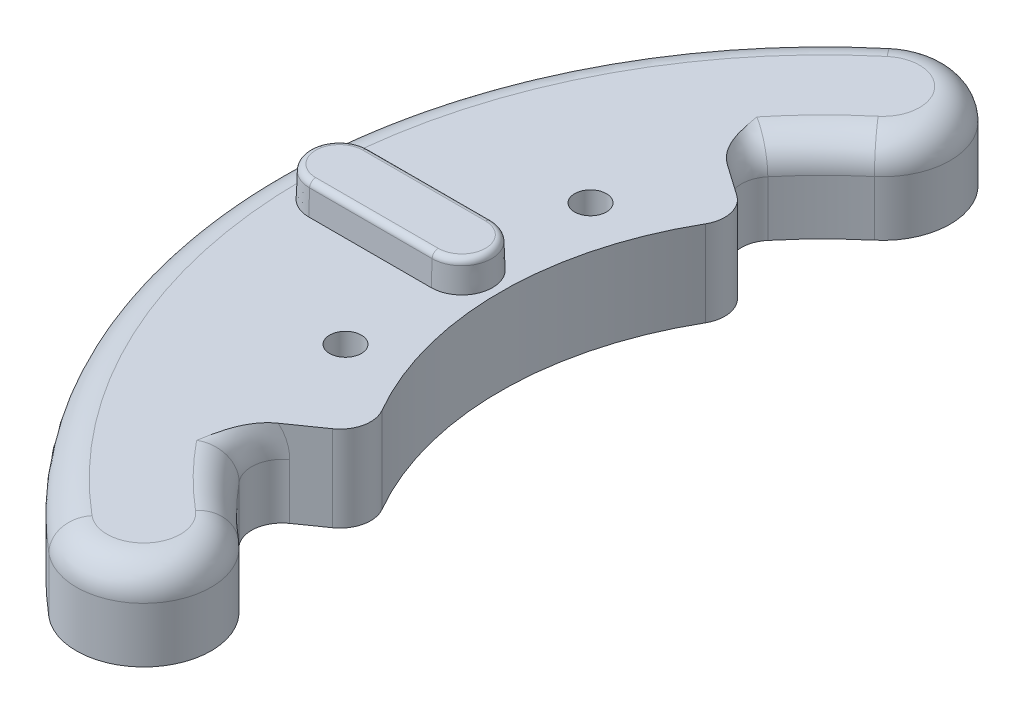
ISO-10303-21;
HEADER;
FILE_DESCRIPTION(('STEP AP214'),'2;1');
FILE_NAME('part.step','',(''),(''),'','','');
FILE_SCHEMA(('AUTOMOTIVE_DESIGN { 1 0 10303 214 1 1 1 1 }'));
ENDSEC;
DATA;
#1=APPLICATION_CONTEXT('core data for automotive mechanical design processes');
#2=APPLICATION_PROTOCOL_DEFINITION('international standard','automotive_design',2000,#1);
#3=PRODUCT_CONTEXT('',#1,'mechanical');
#4=PRODUCT('Part','Part','',(#3));
#5=PRODUCT_RELATED_PRODUCT_CATEGORY('part','',(#4));
#6=PRODUCT_DEFINITION_FORMATION('','',#4);
#7=PRODUCT_DEFINITION_CONTEXT('part definition',#1,'design');
#8=PRODUCT_DEFINITION('design','',#6,#7);
#9=PRODUCT_DEFINITION_SHAPE('','',#8);
#10=(LENGTH_UNIT() NAMED_UNIT(*) SI_UNIT(.MILLI.,.METRE.));
#11=(NAMED_UNIT(*) PLANE_ANGLE_UNIT() SI_UNIT($,.RADIAN.));
#12=(NAMED_UNIT(*) SI_UNIT($,.STERADIAN.) SOLID_ANGLE_UNIT());
#13=UNCERTAINTY_MEASURE_WITH_UNIT(LENGTH_MEASURE(1.E-05),#10,'distance_accuracy_value','');
#14=(GEOMETRIC_REPRESENTATION_CONTEXT(3) GLOBAL_UNCERTAINTY_ASSIGNED_CONTEXT((#13)) GLOBAL_UNIT_ASSIGNED_CONTEXT((#10,
#11,#12)) REPRESENTATION_CONTEXT('',''));
#15=CARTESIAN_POINT('',(0.,0.,0.));
#16=DIRECTION('',(0.,0.,1.));
#17=DIRECTION('',(1.,0.,0.));
#18=AXIS2_PLACEMENT_3D('',#15,#16,#17);
#19=CARTESIAN_POINT('',(-16.0696902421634,8.89,-19.1511110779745));
#20=DIRECTION('',(0.,1.,0.));
#21=DIRECTION('',(0.,0.,1.));
#22=AXIS2_PLACEMENT_3D('',#19,#20,#21);
#23=PLANE('',#22);
#24=CARTESIAN_POINT('',(-36.83,8.89,-12.7));
#25=DIRECTION('',(0.,1.,0.));
#26=DIRECTION('',(0.,0.,1.));
#27=AXIS2_PLACEMENT_3D('',#24,#25,#26);
#28=CIRCLE('',#27,1.65);
#29=CARTESIAN_POINT('',(-36.83,8.89,-11.05));
#30=VERTEX_POINT('',#29);
#31=EDGE_CURVE('E310',#30,#30,#28,.T.);
#32=ORIENTED_EDGE('',*,*,#31,.F.);
#33=EDGE_LOOP('',(#32));
#34=FACE_BOUND('',#33,.T.);
#35=CARTESIAN_POINT('',(-36.83,8.89,12.7));
#36=DIRECTION('',(0.,1.,0.));
#37=DIRECTION('',(0.,0.,1.));
#38=AXIS2_PLACEMENT_3D('',#35,#36,#37);
#39=CIRCLE('',#38,1.65);
#40=CARTESIAN_POINT('',(-36.83,8.89,14.35));
#41=VERTEX_POINT('',#40);
#42=EDGE_CURVE('E338',#41,#41,#39,.T.);
#43=ORIENTED_EDGE('',*,*,#42,.F.);
#44=EDGE_LOOP('',(#43));
#45=FACE_BOUND('',#44,.T.);
#46=CARTESIAN_POINT('',(0.,8.89,0.));
#47=DIRECTION('',(0.,1.,0.));
#48=DIRECTION('',(0.,0.,1.));
#49=AXIS2_PLACEMENT_3D('',#46,#47,#48);
#50=CIRCLE('',#49,33.49);
#51=CARTESIAN_POINT('',(-28.9937583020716,8.89,-16.7613269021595));
#52=VERTEX_POINT('',#51);
#53=CARTESIAN_POINT('',(-28.9937583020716,8.89,16.7613269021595));
#54=VERTEX_POINT('',#53);
#55=EDGE_CURVE('E411',#52,#54,#50,.T.);
#56=ORIENTED_EDGE('',*,*,#55,.F.);
#57=CARTESIAN_POINT('',(-31.7424947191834,8.89,-18.3503747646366));
#58=DIRECTION('',(0.,1.,0.));
#59=DIRECTION('',(0.,0.,1.));
#60=AXIS2_PLACEMENT_3D('',#57,#58,#59);
#61=CIRCLE('',#60,3.175);
#62=CARTESIAN_POINT('',(-29.9213895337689,8.89,-20.9511825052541));
#63=VERTEX_POINT('',#62);
#64=EDGE_CURVE('E770',#52,#63,#61,.T.);
#65=ORIENTED_EDGE('',*,*,#64,.T.);
#66=DIRECTION('',(0.819152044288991,0.,0.573576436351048));
#67=VECTOR('',#66,1.);
#68=CARTESIAN_POINT('',(-27.4334019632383,8.89,-19.2090748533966));
#69=LINE('',#68,#67);
#70=CARTESIAN_POINT('',(-33.2302794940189,8.89,-23.2680921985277));
#71=VERTEX_POINT('',#70);
#72=EDGE_CURVE('E410',#71,#63,#69,.T.);
#73=ORIENTED_EDGE('',*,*,#72,.F.);
#74=CARTESIAN_POINT('',(-32.6457918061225,4.39164823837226,-22.8588295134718));
#75=CARTESIAN_POINT('',(-35.3949968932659,5.10904593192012,-24.7838436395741));
#76=CARTESIAN_POINT('',(-33.2189059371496,5.05332411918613,-27.437141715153));
#77=CARTESIAN_POINT('',(-32.6077465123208,4.60882652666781,-22.8321899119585));
#78=CARTESIAN_POINT('',(-35.3794308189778,5.20905499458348,-24.7729441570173));
#79=CARTESIAN_POINT('',(-33.1985252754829,5.16191326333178,-27.4254659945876));
#80=CARTESIAN_POINT('',(-32.5791145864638,4.82835730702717,-22.8121416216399));
#81=CARTESIAN_POINT('',(-35.367751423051,5.30968966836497,-24.7647661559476));
#82=CARTESIAN_POINT('',(-33.1831843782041,5.27167865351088,-27.4166824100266));
#83=CARTESIAN_POINT('',(-32.5408317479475,5.27022241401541,-22.7853356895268));
#84=CARTESIAN_POINT('',(-35.3521531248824,5.51188476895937,-24.7538441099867));
#85=CARTESIAN_POINT('',(-33.1626706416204,5.49261120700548,-27.4049402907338));
#86=CARTESIAN_POINT('',(-32.5312108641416,5.49256061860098,-22.7785990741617));
#87=CARTESIAN_POINT('',(-35.3482522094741,5.61340979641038,-24.7511126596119));
#88=CARTESIAN_POINT('',(-33.1575138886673,5.60378030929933,-27.4019909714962));
#89=CARTESIAN_POINT('',(-32.5312301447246,6.07098374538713,-22.7786125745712));
#90=CARTESIAN_POINT('',(-35.3482571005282,5.87758115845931,-24.7511160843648));
#91=CARTESIAN_POINT('',(-33.1575244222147,5.89299187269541,-27.401996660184));
#92=CARTESIAN_POINT('',(-32.5559016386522,6.42722662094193,-22.7958877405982));
#93=CARTESIAN_POINT('',(-35.3582543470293,6.04020361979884,-24.7581162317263));
#94=CARTESIAN_POINT('',(-33.1707485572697,6.0711133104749,-27.4095594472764));
#95=CARTESIAN_POINT('',(-32.6539287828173,7.12966455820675,-22.8645270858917));
#96=CARTESIAN_POINT('',(-35.3982907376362,6.36263440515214,-24.7861500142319));
#97=CARTESIAN_POINT('',(-33.2232672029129,6.42233227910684,-27.4396362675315));
#98=CARTESIAN_POINT('',(-32.7273136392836,7.47585346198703,-22.9159117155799));
#99=CARTESIAN_POINT('',(-35.4283046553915,6.52229496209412,-24.8071659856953));
#100=CARTESIAN_POINT('',(-33.262577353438,6.59542673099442,-27.4621592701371));
#101=CARTESIAN_POINT('',(-32.9206217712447,8.14819681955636,-23.0512675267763));
#102=CARTESIAN_POINT('',(-35.5083156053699,6.83550422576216,-24.8631902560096));
#103=CARTESIAN_POINT('',(-33.3660477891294,6.93159840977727,-27.5215771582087));
#104=CARTESIAN_POINT('',(-33.0405295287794,8.47435791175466,-23.1352278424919));
#105=CARTESIAN_POINT('',(-35.5582362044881,6.98893462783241,-24.8981450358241));
#106=CARTESIAN_POINT('',(-33.4301997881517,7.09467895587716,-27.558467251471));
#107=CARTESIAN_POINT('',(-33.3234201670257,9.09749075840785,-23.3333099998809));
#108=CARTESIAN_POINT('',(-35.6777608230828,7.28614939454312,-24.9818370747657));
#109=CARTESIAN_POINT('',(-33.5813974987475,7.40624537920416,-27.6456699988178));
#110=CARTESIAN_POINT('',(-33.4863998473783,9.39446467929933,-23.4474296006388));
#111=CARTESIAN_POINT('',(-35.7472701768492,7.42985372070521,-25.030508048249));
#112=CARTESIAN_POINT('',(-33.6684415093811,7.55473233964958,-27.695981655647));
#113=CARTESIAN_POINT('',(-33.8510556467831,9.95135824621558,-23.702764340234));
#114=CARTESIAN_POINT('',(-35.9053564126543,7.70396905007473,-25.1412012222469));
#115=CARTESIAN_POINT('',(-33.8629653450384,7.83317912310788,-27.8088104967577));
#116=CARTESIAN_POINT('',(-34.0527914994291,10.2112195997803,-23.8440213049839));
#117=CARTESIAN_POINT('',(-35.9938583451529,7.83432674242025,-25.2031709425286));
#118=CARTESIAN_POINT('',(-33.9704767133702,7.96310979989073,-27.8713465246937));
#119=CARTESIAN_POINT('',(-34.4890558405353,10.6860676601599,-24.1494968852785));
#120=CARTESIAN_POINT('',(-36.1884983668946,8.07742512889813,-25.3394593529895));
#121=CARTESIAN_POINT('',(-34.2026712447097,8.20053383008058,-28.0069278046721));
#122=CARTESIAN_POINT('',(-34.723586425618,10.9010514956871,-24.3137169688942));
#123=CARTESIAN_POINT('',(-36.2945352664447,8.19018180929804,-25.4137071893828));
#124=CARTESIAN_POINT('',(-34.3273555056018,8.30802574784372,-28.0799737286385));
#125=CARTESIAN_POINT('',(-35.2195138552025,11.2806888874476,-24.6609690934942));
#126=CARTESIAN_POINT('',(-36.5224549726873,8.39436039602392,-25.5732982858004));
#127=CARTESIAN_POINT('',(-34.5906462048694,8.49784444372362,-28.2348426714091));
#128=CARTESIAN_POINT('',(-35.4809877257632,11.4451924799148,-24.8440550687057));
#129=CARTESIAN_POINT('',(-36.6442975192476,8.4857825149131,-25.6586133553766));
#130=CARTESIAN_POINT('',(-34.7292925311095,8.58009623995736,-28.3166908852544));
#131=CARTESIAN_POINT('',(-36.0227883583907,11.7183825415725,-25.2234279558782));
#132=CARTESIAN_POINT('',(-36.9006592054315,8.6431639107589,-25.8381197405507));
#133=CARTESIAN_POINT('',(-35.0161864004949,8.71669127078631,-28.4867398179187));
#134=CARTESIAN_POINT('',(-36.3031127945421,11.8270758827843,-25.4197132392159));
#135=CARTESIAN_POINT('',(-37.0351156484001,8.70922422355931,-25.9322671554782));
#136=CARTESIAN_POINT('',(-35.1644327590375,8.77103794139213,-28.5749397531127));
#137=CARTESIAN_POINT('',(-36.8752791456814,11.9858164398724,-25.8203484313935));
#138=CARTESIAN_POINT('',(-37.3133531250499,8.8129651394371,-26.1270911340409));
#139=CARTESIAN_POINT('',(-35.466613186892,8.85040821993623,-28.755425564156));
#140=CARTESIAN_POINT('',(-37.1671442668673,12.0357385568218,-26.0247145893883));
#141=CARTESIAN_POINT('',(-37.4571262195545,8.8507049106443,-26.2277621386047));
#142=CARTESIAN_POINT('',(-35.6205586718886,8.87536927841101,-28.8477197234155));
#143=CARTESIAN_POINT('',(-37.7538080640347,12.0750526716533,-26.4355010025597));
#144=CARTESIAN_POINT('',(-37.7496342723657,8.89536659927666,-26.4325784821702));
#145=CARTESIAN_POINT('',(-35.929608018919,8.89502633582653,-29.0336837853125));
#146=CARTESIAN_POINT('',(-38.0486072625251,12.0644336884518,-26.6419216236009));
#147=CARTESIAN_POINT('',(-37.8983756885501,8.90240777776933,-26.5367283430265));
#148=CARTESIAN_POINT('',(-36.0847120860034,8.88971684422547,-29.1273539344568));
#149=CARTESIAN_POINT('',(-38.4862716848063,12.0034229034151,-26.9483775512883));
#150=CARTESIAN_POINT('',(-38.1216867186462,8.88903687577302,-26.6930924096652));
#151=CARTESIAN_POINT('',(-36.3147189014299,8.85921145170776,-29.2667235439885));
#152=CARTESIAN_POINT('',(-38.6314701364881,11.9755489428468,-27.0500466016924));
#153=CARTESIAN_POINT('',(-38.1960956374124,8.88060974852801,-26.7451940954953));
#154=CARTESIAN_POINT('',(-36.3909809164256,8.84527447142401,-29.3130119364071));
#155=CARTESIAN_POINT('',(-38.919469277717,11.9049649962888,-27.2517057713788));
#156=CARTESIAN_POINT('',(-38.3443867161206,8.85577126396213,-26.849028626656));
#157=CARTESIAN_POINT('',(-36.5421632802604,8.80998249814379,-29.4049198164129));
#158=CARTESIAN_POINT('',(-39.0622699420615,11.8622548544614,-27.3516958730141));
#159=CARTESIAN_POINT('',(-38.4182752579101,8.83937306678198,-26.9007659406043));
#160=CARTESIAN_POINT('',(-36.617083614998,8.78862742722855,-29.4505392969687));
#161=CARTESIAN_POINT('',(-39.3445071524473,11.7622490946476,-27.5493204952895));
#162=CARTESIAN_POINT('',(-38.5649520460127,8.79860520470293,-27.0034701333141));
#163=CARTESIAN_POINT('',(-36.7650830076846,8.73862454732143,-29.5407922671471));
#164=CARTESIAN_POINT('',(-39.4839411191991,11.7049426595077,-27.6469532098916));
#165=CARTESIAN_POINT('',(-38.6377475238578,8.77424139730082,-27.0544420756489));
#166=CARTESIAN_POINT('',(-36.8381606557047,8.70997132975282,-29.585424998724));
#167=CARTESIAN_POINT('',(-39.7583626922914,11.5761810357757,-27.8391052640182));
#168=CARTESIAN_POINT('',(-38.7815873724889,8.71767474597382,-27.1551598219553));
#169=CARTESIAN_POINT('',(-36.9819163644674,8.64559051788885,-29.6733478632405));
#170=CARTESIAN_POINT('',(-39.8933500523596,11.504725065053,-27.933624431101));
#171=CARTESIAN_POINT('',(-38.8526408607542,8.68548151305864,-27.2049120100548));
#172=CARTESIAN_POINT('',(-37.0525942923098,8.60986253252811,-29.7166379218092));
#173=CARTESIAN_POINT('',(-40.0256202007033,11.4264081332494,-28.0262409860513));
#174=CARTESIAN_POINT('',(-38.9225737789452,8.6494030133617,-27.2538795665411));
#175=CARTESIAN_POINT('',(-37.1218180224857,8.57070406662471,-29.759093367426));
#176=(BOUNDED_SURFACE() B_SPLINE_SURFACE(3,2,((#74,#75,#76),(#77,#78,#79),(#80,#81,#82),(#83,
#84,#85),(#86,#87,#88),(#89,#90,#91),(#92,#93,#94),(#95,#96,#97),(#98,#99,#100),(#101,#102,
#103),(#104,#105,#106),(#107,#108,#109),(#110,#111,#112),(#113,#114,#115),(#116,#117,#118),
(#119,#120,#121),(#122,#123,#124),(#125,#126,#127),(#128,#129,#130),(#131,#132,#133),(#134,#135,
#136),(#137,#138,#139),(#140,#141,#142),(#143,#144,#145),(#146,#147,#148),(#149,#150,#151),
(#152,#153,#154),(#155,#156,#157),(#158,#159,#160),(#161,#162,#163),(#164,#165,#166),(#167,#168,
#169),(#170,#171,#172),(#173,#174,#175)),.UNSPECIFIED.,.F.,.F.,
.F.) B_SPLINE_SURFACE_WITH_KNOTS((4,2,2,2,2,2,2,2,2,2,2,2,2,2,2,2,4),(3,3),(0.,
0.665759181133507,1.33256912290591,2.399707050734,3.46748536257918,4.53490781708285,
5.60225098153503,6.67125259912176,7.74032259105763,8.81253843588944,9.88462222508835,
10.9589839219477,12.0335404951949,12.5713159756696,13.1090971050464,13.6472779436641,
14.1854885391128),(0.,1.),
.UNSPECIFIED.) GEOMETRIC_REPRESENTATION_ITEM() RATIONAL_B_SPLINE_SURFACE(((1.,0.679090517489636,
1.),(1.,0.678844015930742,1.),(1.,0.678657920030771,1.),(1.,0.678408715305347,1.),(1.,
0.67834580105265,1.),(1.,0.678345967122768,1.),(1.,0.678507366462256,1.),(1.,0.679143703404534,
1.),(1.,0.679618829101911,1.),(1.,0.680854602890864,1.),(1.,0.681615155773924,1.),(1.,
0.683379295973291,1.),(1.,0.684382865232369,1.),(1.,0.686582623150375,1.),(1.,0.687779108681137,
1.),(1.,0.690306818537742,1.),(1.,0.69163805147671,1.),(1.,0.694382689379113,1.),(1.,
0.695796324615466,1.),(1.,0.698648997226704,1.),(1.,0.700088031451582,1.),(1.,0.702947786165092,
1.),(1.,0.704368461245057,1.),(1.,0.707149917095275,1.),(1.,0.708510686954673,1.),(1.,
0.710480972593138,1.),(1.,0.711126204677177,1.),(1.,0.712390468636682,1.),(1.,0.713009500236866,
1.),(1.,0.714218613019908,1.),(1.,0.714808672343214,1.),(1.,0.715956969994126,1.),(1.,
0.716515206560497,1.),(1.,0.717056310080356,1.))) REPRESENTATION_ITEM('') SURFACE());
#177=CARTESIAN_POINT('',(-33.2302794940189,8.89,-23.2680921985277));
#178=CARTESIAN_POINT('',(-33.3417210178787,8.89,-23.3461017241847));
#179=CARTESIAN_POINT('',(-33.4493229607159,8.89,-23.4294561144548));
#180=CARTESIAN_POINT('',(-33.6563938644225,8.89,-23.6054331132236));
#181=CARTESIAN_POINT('',(-33.7558749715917,8.89,-23.698041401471));
#182=CARTESIAN_POINT('',(-33.945439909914,8.89,-23.8901827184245));
#183=CARTESIAN_POINT('',(-34.0356227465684,8.89,-23.9896185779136));
#184=CARTESIAN_POINT('',(-34.2079591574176,8.89,-24.19527011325));
#185=CARTESIAN_POINT('',(-34.2901088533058,8.89,-24.3014890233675));
#186=CARTESIAN_POINT('',(-34.4760747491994,8.89,-24.5608776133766));
#187=CARTESIAN_POINT('',(-34.5763292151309,8.89,-24.7166063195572));
#188=CARTESIAN_POINT('',(-34.7625695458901,8.89,-25.0363430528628));
#189=CARTESIAN_POINT('',(-34.8485509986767,8.89,-25.2003536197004));
#190=CARTESIAN_POINT('',(-35.0078876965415,8.89,-25.5353178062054));
#191=CARTESIAN_POINT('',(-35.0811799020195,8.89,-25.7063011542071));
#192=CARTESIAN_POINT('',(-35.2161936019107,8.89,-26.0528171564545));
#193=CARTESIAN_POINT('',(-35.277909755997,8.89,-26.2283518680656));
#194=CARTESIAN_POINT('',(-35.4713641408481,8.89,-26.8313115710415));
#195=CARTESIAN_POINT('',(-35.5796590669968,8.89,-27.2661439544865));
#196=CARTESIAN_POINT('',(-35.7666693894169,8.89,-28.1408042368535));
#197=CARTESIAN_POINT('',(-35.8454089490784,8.89,-28.5806277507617));
#198=CARTESIAN_POINT('',(-35.924706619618,8.89,-29.0242090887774));
#199=CARTESIAN_POINT('',(-35.9253707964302,8.89,-29.0279244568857));
#200=CARTESIAN_POINT('',(-35.9260349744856,8.89,-29.0316398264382));
#201=B_SPLINE_CURVE_WITH_KNOTS('',3,(#177,#178,#179,#180,#181,#182,#183,#184,#185,#186,#187,
#188,#189,#190,#191,#192,#193,#194,#195,#196,#197,#198,#199,#200),.UNSPECIFIED.,.F.,.F.,(4,2,2,
2,2,2,2,2,2,2,2,4),(0.,0.407821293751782,0.815020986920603,1.21730151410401,1.6197753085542,
2.17452140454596,2.72943866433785,3.28703820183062,3.84489434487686,5.18651188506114,
6.52703016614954,6.53835296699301),.UNSPECIFIED.);
#202=CARTESIAN_POINT('',(-35.9260349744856,8.89,-29.0316398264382));
#203=VERTEX_POINT('',#202);
#204=EDGE_CURVE('E655',#71,#203,#201,.T.);
#205=ORIENTED_EDGE('',*,*,#204,.T.);
#206=CARTESIAN_POINT('',(0.,8.89,0.));
#207=DIRECTION('',(0.,1.,0.));
#208=DIRECTION('',(0.,0.,1.));
#209=AXIS2_PLACEMENT_3D('',#206,#207,#208);
#210=CIRCLE('',#209,46.19);
#211=CARTESIAN_POINT('',(-29.690359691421,8.89,-35.3835928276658));
#212=VERTEX_POINT('',#211);
#213=EDGE_CURVE('E488',#203,#212,#210,.F.);
#214=ORIENTED_EDGE('',*,*,#213,.T.);
#215=CARTESIAN_POINT('',(-32.1393804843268,8.89,-38.3022221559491));
#216=DIRECTION('',(0.,1.,0.));
#217=DIRECTION('',(0.,0.,1.));
#218=AXIS2_PLACEMENT_3D('',#215,#216,#217);
#219=CIRCLE('',#218,3.81000000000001);
#220=CARTESIAN_POINT('',(-34.5884012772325,8.89,-41.2208514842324));
#221=VERTEX_POINT('',#220);
#222=EDGE_CURVE('E486',#212,#221,#219,.T.);
#223=ORIENTED_EDGE('',*,*,#222,.T.);
#224=CARTESIAN_POINT('',(0.,8.89,0.));
#225=DIRECTION('',(0.,1.,0.));
#226=DIRECTION('',(0.,0.,1.));
#227=AXIS2_PLACEMENT_3D('',#224,#225,#226);
#228=CIRCLE('',#227,53.81);
#229=CARTESIAN_POINT('',(-34.5884012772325,8.89,41.2208514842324));
#230=VERTEX_POINT('',#229);
#231=EDGE_CURVE('E479',#221,#230,#228,.T.);
#232=ORIENTED_EDGE('',*,*,#231,.T.);
#233=CARTESIAN_POINT('',(-32.1393804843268,8.89,38.3022221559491));
#234=DIRECTION('',(0.,1.,0.));
#235=DIRECTION('',(0.,0.,1.));
#236=AXIS2_PLACEMENT_3D('',#233,#234,#235);
#237=CIRCLE('',#236,3.81000000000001);
#238=CARTESIAN_POINT('',(-29.6903596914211,8.89,35.3835928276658));
#239=VERTEX_POINT('',#238);
#240=EDGE_CURVE('E481',#230,#239,#237,.T.);
#241=ORIENTED_EDGE('',*,*,#240,.T.);
#242=CARTESIAN_POINT('',(0.,8.89,0.));
#243=DIRECTION('',(0.,1.,0.));
#244=DIRECTION('',(0.,0.,1.));
#245=AXIS2_PLACEMENT_3D('',#242,#243,#244);
#246=CIRCLE('',#245,46.19);
#247=CARTESIAN_POINT('',(-35.9260349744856,8.89,29.0316398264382));
#248=VERTEX_POINT('',#247);
#249=EDGE_CURVE('E483',#239,#248,#246,.F.);
#250=ORIENTED_EDGE('',*,*,#249,.T.);
#251=CARTESIAN_POINT('',(-33.2189059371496,5.05332411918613,27.437141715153));
#252=CARTESIAN_POINT('',(-35.3949968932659,5.10904593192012,24.7838436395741));
#253=CARTESIAN_POINT('',(-32.6457918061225,4.39164823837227,22.8588295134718));
#254=CARTESIAN_POINT('',(-33.1985252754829,5.16191326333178,27.4254659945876));
#255=CARTESIAN_POINT('',(-35.3794308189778,5.20905499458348,24.7729441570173));
#256=CARTESIAN_POINT('',(-32.6077465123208,4.60882652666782,22.8321899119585));
#257=CARTESIAN_POINT('',(-33.1831843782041,5.27167865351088,27.4166824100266));
#258=CARTESIAN_POINT('',(-35.367751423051,5.30968966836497,24.7647661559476));
#259=CARTESIAN_POINT('',(-32.5791145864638,4.82835730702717,22.8121416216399));
#260=CARTESIAN_POINT('',(-33.1626706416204,5.49261120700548,27.4049402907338));
#261=CARTESIAN_POINT('',(-35.3521531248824,5.51188476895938,24.7538441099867));
#262=CARTESIAN_POINT('',(-32.5408317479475,5.27022241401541,22.7853356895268));
#263=CARTESIAN_POINT('',(-33.1575138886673,5.60378030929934,27.4019909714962));
#264=CARTESIAN_POINT('',(-35.3482522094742,5.61340979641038,24.7511126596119));
#265=CARTESIAN_POINT('',(-32.5312108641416,5.49256061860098,22.7785990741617));
#266=CARTESIAN_POINT('',(-33.1575244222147,5.89299187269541,27.401996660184));
#267=CARTESIAN_POINT('',(-35.3482571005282,5.87758115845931,24.7511160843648));
#268=CARTESIAN_POINT('',(-32.5312301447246,6.07098374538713,22.7786125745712));
#269=CARTESIAN_POINT('',(-33.1707485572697,6.0711133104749,27.4095594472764));
#270=CARTESIAN_POINT('',(-35.3582543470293,6.04020361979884,24.7581162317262));
#271=CARTESIAN_POINT('',(-32.5559016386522,6.42722662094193,22.7958877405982));
#272=CARTESIAN_POINT('',(-33.2232672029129,6.42233227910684,27.4396362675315));
#273=CARTESIAN_POINT('',(-35.3982907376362,6.36263440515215,24.7861500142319));
#274=CARTESIAN_POINT('',(-32.6539287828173,7.12966455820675,22.8645270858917));
#275=CARTESIAN_POINT('',(-33.262577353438,6.59542673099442,27.4621592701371));
#276=CARTESIAN_POINT('',(-35.4283046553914,6.52229496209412,24.8071659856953));
#277=CARTESIAN_POINT('',(-32.7273136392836,7.47585346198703,22.9159117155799));
#278=CARTESIAN_POINT('',(-33.3660477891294,6.93159840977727,27.5215771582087));
#279=CARTESIAN_POINT('',(-35.5083156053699,6.83550422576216,24.8631902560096));
#280=CARTESIAN_POINT('',(-32.9206217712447,8.14819681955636,23.0512675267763));
#281=CARTESIAN_POINT('',(-33.4301997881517,7.09467895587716,27.558467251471));
#282=CARTESIAN_POINT('',(-35.5582362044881,6.98893462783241,24.8981450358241));
#283=CARTESIAN_POINT('',(-33.0405295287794,8.47435791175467,23.1352278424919));
#284=CARTESIAN_POINT('',(-33.5813974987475,7.40624537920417,27.6456699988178));
#285=CARTESIAN_POINT('',(-35.6777608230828,7.28614939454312,24.9818370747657));
#286=CARTESIAN_POINT('',(-33.3234201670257,9.09749075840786,23.3333099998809));
#287=CARTESIAN_POINT('',(-33.6684415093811,7.55473233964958,27.695981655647));
#288=CARTESIAN_POINT('',(-35.7472701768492,7.42985372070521,25.030508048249));
#289=CARTESIAN_POINT('',(-33.4863998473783,9.39446467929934,23.4474296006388));
#290=CARTESIAN_POINT('',(-33.8629653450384,7.83317912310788,27.8088104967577));
#291=CARTESIAN_POINT('',(-35.9053564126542,7.70396905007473,25.1412012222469));
#292=CARTESIAN_POINT('',(-33.8510556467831,9.95135824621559,23.702764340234));
#293=CARTESIAN_POINT('',(-33.9704767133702,7.96310979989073,27.8713465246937));
#294=CARTESIAN_POINT('',(-35.9938583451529,7.83432674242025,25.2031709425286));
#295=CARTESIAN_POINT('',(-34.0527914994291,10.2112195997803,23.8440213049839));
#296=CARTESIAN_POINT('',(-34.2026712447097,8.20053383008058,28.0069278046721));
#297=CARTESIAN_POINT('',(-36.1884983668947,8.07742512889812,25.3394593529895));
#298=CARTESIAN_POINT('',(-34.4890558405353,10.6860676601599,24.1494968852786));
#299=CARTESIAN_POINT('',(-34.3273555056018,8.30802574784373,28.0799737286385));
#300=CARTESIAN_POINT('',(-36.2945352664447,8.19018180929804,25.4137071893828));
#301=CARTESIAN_POINT('',(-34.7235864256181,10.9010514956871,24.3137169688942));
#302=CARTESIAN_POINT('',(-34.5906462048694,8.49784444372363,28.2348426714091));
#303=CARTESIAN_POINT('',(-36.5224549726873,8.39436039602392,25.5732982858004));
#304=CARTESIAN_POINT('',(-35.2195138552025,11.2806888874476,24.6609690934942));
#305=CARTESIAN_POINT('',(-34.7292925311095,8.58009623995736,28.3166908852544));
#306=CARTESIAN_POINT('',(-36.6442975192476,8.48578251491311,25.6586133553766));
#307=CARTESIAN_POINT('',(-35.4809877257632,11.4451924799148,24.8440550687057));
#308=CARTESIAN_POINT('',(-35.0161864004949,8.71669127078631,28.4867398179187));
#309=CARTESIAN_POINT('',(-36.9006592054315,8.64316391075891,25.8381197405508));
#310=CARTESIAN_POINT('',(-36.0227883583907,11.7183825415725,25.2234279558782));
#311=CARTESIAN_POINT('',(-35.1644327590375,8.77103794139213,28.5749397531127));
#312=CARTESIAN_POINT('',(-37.0351156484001,8.70922422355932,25.9322671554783));
#313=CARTESIAN_POINT('',(-36.3031127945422,11.8270758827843,25.4197132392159));
#314=CARTESIAN_POINT('',(-35.466613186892,8.85040821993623,28.755425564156));
#315=CARTESIAN_POINT('',(-37.3133531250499,8.8129651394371,26.1270911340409));
#316=CARTESIAN_POINT('',(-36.8752791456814,11.9858164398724,25.8203484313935));
#317=CARTESIAN_POINT('',(-35.6205586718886,8.87536927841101,28.8477197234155));
#318=CARTESIAN_POINT('',(-37.4571262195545,8.8507049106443,26.2277621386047));
#319=CARTESIAN_POINT('',(-37.1671442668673,12.0357385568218,26.0247145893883));
#320=CARTESIAN_POINT('',(-35.929608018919,8.89502633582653,29.0336837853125));
#321=CARTESIAN_POINT('',(-37.7496342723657,8.89536659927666,26.4325784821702));
#322=CARTESIAN_POINT('',(-37.7538080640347,12.0750526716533,26.4355010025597));
#323=CARTESIAN_POINT('',(-36.0847120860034,8.88971684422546,29.1273539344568));
#324=CARTESIAN_POINT('',(-37.8983756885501,8.90240777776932,26.5367283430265));
#325=CARTESIAN_POINT('',(-38.0486072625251,12.0644336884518,26.6419216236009));
#326=CARTESIAN_POINT('',(-36.3147189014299,8.85921145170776,29.2667235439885));
#327=CARTESIAN_POINT('',(-38.1216867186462,8.88903687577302,26.6930924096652));
#328=CARTESIAN_POINT('',(-38.4862716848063,12.0034229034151,26.9483775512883));
#329=CARTESIAN_POINT('',(-36.3909809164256,8.84527447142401,29.3130119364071));
#330=CARTESIAN_POINT('',(-38.1960956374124,8.88060974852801,26.7451940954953));
#331=CARTESIAN_POINT('',(-38.6314701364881,11.9755489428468,27.0500466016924));
#332=CARTESIAN_POINT('',(-36.5421632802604,8.80998249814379,29.4049198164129));
#333=CARTESIAN_POINT('',(-38.3443867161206,8.85577126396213,26.849028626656));
#334=CARTESIAN_POINT('',(-38.919469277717,11.9049649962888,27.2517057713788));
#335=CARTESIAN_POINT('',(-36.617083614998,8.78862742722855,29.4505392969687));
#336=CARTESIAN_POINT('',(-38.4182752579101,8.83937306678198,26.9007659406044));
#337=CARTESIAN_POINT('',(-39.0622699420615,11.8622548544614,27.3516958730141));
#338=CARTESIAN_POINT('',(-36.7650830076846,8.73862454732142,29.5407922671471));
#339=CARTESIAN_POINT('',(-38.5649520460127,8.79860520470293,27.0034701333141));
#340=CARTESIAN_POINT('',(-39.3445071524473,11.7622490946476,27.5493204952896));
#341=CARTESIAN_POINT('',(-36.8381606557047,8.70997132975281,29.585424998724));
#342=CARTESIAN_POINT('',(-38.6377475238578,8.77424139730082,27.0544420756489));
#343=CARTESIAN_POINT('',(-39.4839411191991,11.7049426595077,27.6469532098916));
#344=CARTESIAN_POINT('',(-36.9819163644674,8.64559051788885,29.6733478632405));
#345=CARTESIAN_POINT('',(-38.7815873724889,8.71767474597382,27.1551598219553));
#346=CARTESIAN_POINT('',(-39.7583626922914,11.5761810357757,27.8391052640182));
#347=CARTESIAN_POINT('',(-37.0525942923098,8.60986253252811,29.7166379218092));
#348=CARTESIAN_POINT('',(-38.8526408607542,8.68548151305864,27.2049120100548));
#349=CARTESIAN_POINT('',(-39.8933500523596,11.504725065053,27.933624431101));
#350=CARTESIAN_POINT('',(-37.1218180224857,8.57070406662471,29.759093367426));
#351=CARTESIAN_POINT('',(-38.9225737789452,8.64940301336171,27.2538795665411));
#352=CARTESIAN_POINT('',(-40.0256202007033,11.4264081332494,28.0262409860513));
#353=(BOUNDED_SURFACE() B_SPLINE_SURFACE(3,2,((#251,#252,#253),(#254,#255,#256),(#257,#258,
#259),(#260,#261,#262),(#263,#264,#265),(#266,#267,#268),(#269,#270,#271),(#272,#273,#274),
(#275,#276,#277),(#278,#279,#280),(#281,#282,#283),(#284,#285,#286),(#287,#288,#289),(#290,#291,
#292),(#293,#294,#295),(#296,#297,#298),(#299,#300,#301),(#302,#303,#304),(#305,#306,#307),
(#308,#309,#310),(#311,#312,#313),(#314,#315,#316),(#317,#318,#319),(#320,#321,#322),(#323,#324,
#325),(#326,#327,#328),(#329,#330,#331),(#332,#333,#334),(#335,#336,#337),(#338,#339,#340),
(#341,#342,#343),(#344,#345,#346),(#347,#348,#349),(#350,#351,#352)),.UNSPECIFIED.,.F.,.F.,
.F.) B_SPLINE_SURFACE_WITH_KNOTS((4,2,2,2,2,2,2,2,2,2,2,2,2,2,2,2,4),(3,3),(0.,
0.665759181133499,1.33256912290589,2.39970705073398,3.46748536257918,4.53490781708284,
5.60225098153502,6.67125259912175,7.74032259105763,8.81253843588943,9.88462222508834,
10.9589839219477,12.0335404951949,12.5713159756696,13.1090971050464,13.6472779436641,
14.1854885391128),(0.,1.),
.UNSPECIFIED.) GEOMETRIC_REPRESENTATION_ITEM() RATIONAL_B_SPLINE_SURFACE(((1.,0.679090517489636,
1.),(1.,0.678844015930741,1.),(1.,0.678657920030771,1.),(1.,0.678408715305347,1.),(1.,
0.67834580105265,1.),(1.,0.678345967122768,1.),(1.,0.678507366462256,1.),(1.,0.679143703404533,
1.),(1.,0.679618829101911,1.),(1.,0.680854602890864,1.),(1.,0.681615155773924,1.),(1.,
0.683379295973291,1.),(1.,0.684382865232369,1.),(1.,0.686582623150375,1.),(1.,0.687779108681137,
1.),(1.,0.690306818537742,1.),(1.,0.69163805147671,1.),(1.,0.694382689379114,1.),(1.,
0.695796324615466,1.),(1.,0.698648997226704,1.),(1.,0.700088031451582,1.),(1.,0.702947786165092,
1.),(1.,0.704368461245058,1.),(1.,0.707149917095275,1.),(1.,0.708510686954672,1.),(1.,
0.710480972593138,1.),(1.,0.711126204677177,1.),(1.,0.712390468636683,1.),(1.,0.713009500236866,
1.),(1.,0.714218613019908,1.),(1.,0.714808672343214,1.),(1.,0.715956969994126,1.),(1.,
0.716515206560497,1.),(1.,0.717056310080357,1.))) REPRESENTATION_ITEM('') SURFACE());
#354=CARTESIAN_POINT('',(-33.2302794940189,8.88999999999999,23.2680921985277));
#355=CARTESIAN_POINT('',(-33.3417210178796,8.89,23.346101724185));
#356=CARTESIAN_POINT('',(-33.4493229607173,8.89,23.4294561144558));
#357=CARTESIAN_POINT('',(-33.6563938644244,8.89,23.6054331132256));
#358=CARTESIAN_POINT('',(-33.7558749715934,8.89,23.6980414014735));
#359=CARTESIAN_POINT('',(-33.9454399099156,8.89,23.890182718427));
#360=CARTESIAN_POINT('',(-34.0356227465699,8.89,23.9896185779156));
#361=CARTESIAN_POINT('',(-34.2079591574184,8.89,24.1952701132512));
#362=CARTESIAN_POINT('',(-34.2901088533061,8.89,24.3014890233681));
#363=CARTESIAN_POINT('',(-34.4760747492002,8.89,24.5608776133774));
#364=CARTESIAN_POINT('',(-34.5763292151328,8.89,24.7166063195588));
#365=CARTESIAN_POINT('',(-34.7625695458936,8.89,25.0363430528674));
#366=CARTESIAN_POINT('',(-34.8485509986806,8.89,25.2003536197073));
#367=CARTESIAN_POINT('',(-35.0078876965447,8.89,25.5353178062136));
#368=CARTESIAN_POINT('',(-35.0811799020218,8.89,25.7063011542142));
#369=CARTESIAN_POINT('',(-35.2161936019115,8.89,26.0528171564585));
#370=CARTESIAN_POINT('',(-35.2779097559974,8.89,26.2283518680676));
#371=CARTESIAN_POINT('',(-35.4713641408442,8.89,26.8313115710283));
#372=CARTESIAN_POINT('',(-35.5796590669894,8.89,27.2661439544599));
#373=CARTESIAN_POINT('',(-35.7666693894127,8.89,28.1408042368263));
#374=CARTESIAN_POINT('',(-35.8454089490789,8.89,28.5806277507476));
#375=CARTESIAN_POINT('',(-35.924706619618,8.89,29.0242090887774));
#376=CARTESIAN_POINT('',(-35.9253707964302,8.89,29.0279244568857));
#377=CARTESIAN_POINT('',(-35.9260349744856,8.89,29.0316398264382));
#378=B_SPLINE_CURVE_WITH_KNOTS('',3,(#354,#355,#356,#357,#358,#359,#360,#361,#362,#363,#364,
#365,#366,#367,#368,#369,#370,#371,#372,#373,#374,#375,#376,#377),.UNSPECIFIED.,.F.,.F.,(4,2,2,
2,2,2,2,2,2,2,2,4),(0.,0.407821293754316,0.815020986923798,1.21730151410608,1.61977530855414,
2.17452140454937,2.72943866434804,3.28703820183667,3.84489434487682,5.1865118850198,
6.52703016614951,6.53835296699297),.UNSPECIFIED.);
#379=CARTESIAN_POINT('',(-33.2302794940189,8.89,23.2680921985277));
#380=VERTEX_POINT('',#379);
#381=EDGE_CURVE('E648',#248,#380,#378,.F.);
#382=ORIENTED_EDGE('',*,*,#381,.T.);
#383=DIRECTION('',(-0.819152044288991,0.,0.573576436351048));
#384=VECTOR('',#383,1.);
#385=CARTESIAN_POINT('',(-27.4334019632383,8.89,19.2090748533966));
#386=LINE('',#385,#384);
#387=CARTESIAN_POINT('',(-29.9213895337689,8.89,20.9511825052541));
#388=VERTEX_POINT('',#387);
#389=EDGE_CURVE('E402',#388,#380,#386,.T.);
#390=ORIENTED_EDGE('',*,*,#389,.F.);
#391=CARTESIAN_POINT('',(-31.7424947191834,8.89,18.3503747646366));
#392=DIRECTION('',(0.,1.,0.));
#393=DIRECTION('',(0.,0.,1.));
#394=AXIS2_PLACEMENT_3D('',#391,#392,#393);
#395=CIRCLE('',#394,3.175);
#396=EDGE_CURVE('E771',#388,#54,#395,.T.);
#397=ORIENTED_EDGE('',*,*,#396,.T.);
#398=EDGE_LOOP('',(#56,#65,#73,#205,#214,#223,#232,#241,#250,#382,#390,#397));
#399=FACE_BOUND('',#398,.T.);
#400=DIRECTION('',(1.,0.,0.));
#401=VECTOR('',#400,1.);
#402=CARTESIAN_POINT('',(-50.165,8.89,3.175));
#403=LINE('',#402,#401);
#404=CARTESIAN_POINT('',(-50.165,8.89,3.175));
#405=VERTEX_POINT('',#404);
#406=CARTESIAN_POINT('',(-37.465,8.89,3.175));
#407=VERTEX_POINT('',#406);
#408=EDGE_CURVE('E306',#405,#407,#403,.T.);
#409=ORIENTED_EDGE('',*,*,#408,.F.);
#410=CARTESIAN_POINT('',(-50.165,8.89,0.));
#411=DIRECTION('',(0.,1.,0.));
#412=DIRECTION('',(0.,0.,1.));
#413=AXIS2_PLACEMENT_3D('',#410,#411,#412);
#414=CIRCLE('',#413,3.175);
#415=CARTESIAN_POINT('',(-50.165,8.89,-3.175));
#416=VERTEX_POINT('',#415);
#417=EDGE_CURVE('E314',#416,#405,#414,.T.);
#418=ORIENTED_EDGE('',*,*,#417,.F.);
#419=DIRECTION('',(-1.,0.,0.));
#420=VECTOR('',#419,1.);
#421=CARTESIAN_POINT('',(-50.165,8.89,-3.175));
#422=LINE('',#421,#420);
#423=CARTESIAN_POINT('',(-37.465,8.89,-3.17500000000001));
#424=VERTEX_POINT('',#423);
#425=EDGE_CURVE('E325',#424,#416,#422,.T.);
#426=ORIENTED_EDGE('',*,*,#425,.F.);
#427=CARTESIAN_POINT('',(-37.465,8.89,0.));
#428=DIRECTION('',(0.,1.,0.));
#429=DIRECTION('',(0.,0.,1.));
#430=AXIS2_PLACEMENT_3D('',#427,#428,#429);
#431=CIRCLE('',#430,3.175);
#432=EDGE_CURVE('E323',#407,#424,#431,.T.);
#433=ORIENTED_EDGE('',*,*,#432,.F.);
#434=EDGE_LOOP('',(#409,#418,#426,#433));
#435=FACE_BOUND('',#434,.T.);
#436=ADVANCED_FACE('F82',(#34,#45,#399,#435),#23,.T.);
#437=CARTESIAN_POINT('',(-16.0696902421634,5.715,-19.1511110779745));
#438=DIRECTION('',(0.,1.,0.));
#439=DIRECTION('',(0.,0.,1.));
#440=AXIS2_PLACEMENT_3D('',#437,#438,#439);
#441=PLANE('',#440);
#442=CARTESIAN_POINT('',(0.,5.715,0.));
#443=DIRECTION('',(0.,1.,0.));
#444=DIRECTION('',(0.,0.,1.));
#445=AXIS2_PLACEMENT_3D('',#442,#443,#444);
#446=CIRCLE('',#445,53.2982576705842);
#447=CARTESIAN_POINT('',(-30.4318978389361,5.715,43.7561865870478));
#448=VERTEX_POINT('',#447);
#449=CARTESIAN_POINT('',(-50.5243385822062,5.715,-16.970429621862));
#450=VERTEX_POINT('',#449);
#451=EDGE_CURVE('E474',#448,#450,#446,.F.);
#452=ORIENTED_EDGE('',*,*,#451,.F.);
#453=CARTESIAN_POINT('',(-32.1393804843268,5.715,38.3022221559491));
#454=DIRECTION('',(0.,1.,0.));
#455=DIRECTION('',(0.,0.,1.));
#456=AXIS2_PLACEMENT_3D('',#453,#454,#455);
#457=CIRCLE('',#456,5.71500000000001);
#458=CARTESIAN_POINT('',(-35.8129116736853,5.715,42.6801661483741));
#459=VERTEX_POINT('',#458);
#460=EDGE_CURVE('E468',#459,#448,#457,.T.);
#461=ORIENTED_EDGE('',*,*,#460,.F.);
#462=CARTESIAN_POINT('',(0.,5.715,0.));
#463=DIRECTION('',(0.,1.,0.));
#464=DIRECTION('',(0.,0.,1.));
#465=AXIS2_PLACEMENT_3D('',#462,#463,#464);
#466=CIRCLE('',#465,55.715);
#467=CARTESIAN_POINT('',(-35.8129116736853,5.715,-42.6801661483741));
#468=VERTEX_POINT('',#467);
#469=EDGE_CURVE('E465',#468,#459,#466,.T.);
#470=ORIENTED_EDGE('',*,*,#469,.F.);
#471=CARTESIAN_POINT('',(-32.1393804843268,5.715,-38.3022221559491));
#472=DIRECTION('',(0.,1.,0.));
#473=DIRECTION('',(0.,0.,1.));
#474=AXIS2_PLACEMENT_3D('',#471,#472,#473);
#475=CIRCLE('',#474,5.71500000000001);
#476=CARTESIAN_POINT('',(-28.4658492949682,5.715,-33.9242781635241));
#477=VERTEX_POINT('',#476);
#478=EDGE_CURVE('E435',#477,#468,#475,.T.);
#479=ORIENTED_EDGE('',*,*,#478,.F.);
#480=CARTESIAN_POINT('',(0.,5.715,0.));
#481=DIRECTION('',(0.,1.,0.));
#482=DIRECTION('',(0.,0.,1.));
#483=AXIS2_PLACEMENT_3D('',#480,#481,#482);
#484=CIRCLE('',#483,44.285);
#485=CARTESIAN_POINT('',(-28.4658492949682,5.715,33.9242781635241));
#486=VERTEX_POINT('',#485);
#487=EDGE_CURVE('E425',#486,#477,#484,.F.);
#488=ORIENTED_EDGE('',*,*,#487,.F.);
#489=CARTESIAN_POINT('',(-29.3310344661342,5.715,43.2796128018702));
#490=VERTEX_POINT('',#489);
#491=EDGE_CURVE('E467',#490,#486,#457,.T.);
#492=ORIENTED_EDGE('',*,*,#491,.F.);
#493=CARTESIAN_POINT('',(0.,5.715,0.));
#494=DIRECTION('',(0.,1.,0.));
#495=DIRECTION('',(0.,0.,1.));
#496=AXIS2_PLACEMENT_3D('',#493,#494,#495);
#497=CIRCLE('',#496,52.2822576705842);
#498=CARTESIAN_POINT('',(-49.5612165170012,5.715,-16.6469301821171));
#499=VERTEX_POINT('',#498);
#500=EDGE_CURVE('E462',#490,#499,#497,.F.);
#501=ORIENTED_EDGE('',*,*,#500,.T.);
#502=DIRECTION('',(-0.947954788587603,0.,-0.318404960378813));
#503=VECTOR('',#502,1.);
#504=CARTESIAN_POINT('',(-49.5612165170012,5.715,-16.6469301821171));
#505=LINE('',#504,#503);
#506=EDGE_CURVE('E376',#499,#450,#505,.T.);
#507=ORIENTED_EDGE('',*,*,#506,.T.);
#508=EDGE_LOOP('',(#452,#461,#470,#479,#488,#492,#501,#507));
#509=FACE_BOUND('',#508,.T.);
#510=CARTESIAN_POINT('',(0.,5.715,0.));
#511=DIRECTION('',(0.,-1.,0.));
#512=DIRECTION('',(1.,0.,0.));
#513=AXIS2_PLACEMENT_3D('',#510,#511,#512);
#514=CIRCLE('',#513,46.7021849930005);
#515=CARTESIAN_POINT('',(-37.5418718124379,5.715,-27.7795238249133));
#516=VERTEX_POINT('',#515);
#517=CARTESIAN_POINT('',(-44.5968101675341,5.715,13.8642924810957));
#518=VERTEX_POINT('',#517);
#519=EDGE_CURVE('E354',#516,#518,#514,.F.);
#520=ORIENTED_EDGE('',*,*,#519,.F.);
#521=DIRECTION('',(-0.803856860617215,0.,-0.594822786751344));
#522=VECTOR('',#521,1.);
#523=CARTESIAN_POINT('',(-37.5418718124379,5.715,-27.7795238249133));
#524=LINE('',#523,#522);
#525=CARTESIAN_POINT('',(-38.3585903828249,5.715,-28.3838637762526));
#526=VERTEX_POINT('',#525);
#527=EDGE_CURVE('E364',#516,#526,#524,.T.);
#528=ORIENTED_EDGE('',*,*,#527,.T.);
#529=CARTESIAN_POINT('',(0.,5.715,0.));
#530=DIRECTION('',(0.,-1.,0.));
#531=DIRECTION('',(1.,0.,0.));
#532=AXIS2_PLACEMENT_3D('',#529,#530,#531);
#533=CIRCLE('',#532,47.7181849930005);
#534=CARTESIAN_POINT('',(-45.5670080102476,5.715,14.1659083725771));
#535=VERTEX_POINT('',#534);
#536=EDGE_CURVE('E361',#526,#535,#533,.F.);
#537=ORIENTED_EDGE('',*,*,#536,.T.);
#538=DIRECTION('',(0.95491913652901,0.,-0.296866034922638));
#539=VECTOR('',#538,1.);
#540=CARTESIAN_POINT('',(-45.5670080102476,5.715,14.1659083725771));
#541=LINE('',#540,#539);
#542=EDGE_CURVE('E357',#535,#518,#541,.T.);
#543=ORIENTED_EDGE('',*,*,#542,.T.);
#544=EDGE_LOOP('',(#520,#528,#537,#543));
#545=FACE_BOUND('',#544,.T.);
#546=ADVANCED_FACE('F628',(#509,#545),#441,.F.);
#547=CARTESIAN_POINT('',(-32.1393804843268,8.89,38.3022221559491));
#548=DIRECTION('',(0.,-1.,0.));
#549=DIRECTION('',(0.,0.,-1.));
#550=AXIS2_PLACEMENT_3D('',#547,#548,#549);
#551=CYLINDRICAL_SURFACE('',#550,5.71500000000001);
#552=ORIENTED_EDGE('',*,*,#460,.T.);
#553=DIRECTION('',(0.,1.,0.));
#554=VECTOR('',#553,1.);
#555=CARTESIAN_POINT('',(-30.4318978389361,3.175,43.7561865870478));
#556=LINE('',#555,#554);
#557=CARTESIAN_POINT('',(-30.431897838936,0.635,43.7561865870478));
#558=VERTEX_POINT('',#557);
#559=EDGE_CURVE('E395',#448,#558,#556,.F.);
#560=ORIENTED_EDGE('',*,*,#559,.T.);
#561=CARTESIAN_POINT('',(-32.1393804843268,0.635,38.3022221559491));
#562=DIRECTION('',(0.,1.,0.));
#563=DIRECTION('',(0.,0.,1.));
#564=AXIS2_PLACEMENT_3D('',#561,#562,#563);
#565=CIRCLE('',#564,5.71500000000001);
#566=CARTESIAN_POINT('',(-29.3310344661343,0.635,43.2796128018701));
#567=VERTEX_POINT('',#566);
#568=EDGE_CURVE('E476',#558,#567,#565,.T.);
#569=ORIENTED_EDGE('',*,*,#568,.T.);
#570=DIRECTION('',(0.,1.,0.));
#571=VECTOR('',#570,1.);
#572=CARTESIAN_POINT('',(-29.3310344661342,3.175,43.2796128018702));
#573=LINE('',#572,#571);
#574=EDGE_CURVE('E386',#490,#567,#573,.F.);
#575=ORIENTED_EDGE('',*,*,#574,.F.);
#576=ORIENTED_EDGE('',*,*,#491,.T.);
#577=DIRECTION('',(0.,-1.,0.));
#578=VECTOR('',#577,1.);
#579=CARTESIAN_POINT('',(-28.4658492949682,8.89,33.9242781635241));
#580=LINE('',#579,#578);
#581=CARTESIAN_POINT('',(-28.4658492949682,0.,33.9242781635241));
#582=VERTEX_POINT('',#581);
#583=EDGE_CURVE('E424',#486,#582,#580,.T.);
#584=ORIENTED_EDGE('',*,*,#583,.T.);
#585=CARTESIAN_POINT('',(-32.1393804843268,0.,38.3022221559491));
#586=DIRECTION('',(0.,1.,0.));
#587=DIRECTION('',(0.,0.,1.));
#588=AXIS2_PLACEMENT_3D('',#585,#586,#587);
#589=CIRCLE('',#588,5.71500000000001);
#590=CARTESIAN_POINT('',(-35.8129116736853,0.,42.6801661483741));
#591=VERTEX_POINT('',#590);
#592=EDGE_CURVE('E436',#591,#582,#589,.T.);
#593=ORIENTED_EDGE('',*,*,#592,.F.);
#594=DIRECTION('',(0.,-1.,0.));
#595=VECTOR('',#594,1.);
#596=CARTESIAN_POINT('',(-35.8129116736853,8.89,42.6801661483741));
#597=LINE('',#596,#595);
#598=EDGE_CURVE('E421',#459,#591,#597,.T.);
#599=ORIENTED_EDGE('',*,*,#598,.F.);
#600=EDGE_LOOP('',(#552,#560,#569,#575,#576,#584,#593,#599));
#601=FACE_BOUND('',#600,.T.);
#602=ADVANCED_FACE('F636',(#601),#551,.F.);
#603=CARTESIAN_POINT('',(0.,8.89,0.));
#604=DIRECTION('',(0.,-1.,0.));
#605=DIRECTION('',(0.,0.,-1.));
#606=AXIS2_PLACEMENT_3D('',#603,#604,#605);
#607=CYLINDRICAL_SURFACE('',#606,43.015);
#608=CARTESIAN_POINT('',(0.,0.,0.));
#609=DIRECTION('',(0.,-1.,0.));
#610=DIRECTION('',(0.,0.,1.));
#611=AXIS2_PLACEMENT_3D('',#608,#609,#610);
#612=CIRCLE('',#611,43.015);
#613=CARTESIAN_POINT('',(-27.6495090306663,0.,32.951401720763));
#614=VERTEX_POINT('',#613);
#615=CARTESIAN_POINT('',(-33.1575179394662,0.,27.4019931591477));
#616=VERTEX_POINT('',#615);
#617=EDGE_CURVE('E450',#614,#616,#612,.T.);
#618=ORIENTED_EDGE('',*,*,#617,.T.);
#619=DIRECTION('',(0.,-1.,0.));
#620=VECTOR('',#619,1.);
#621=CARTESIAN_POINT('',(-33.1575179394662,8.89,27.4019931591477));
#622=LINE('',#621,#620);
#623=CARTESIAN_POINT('',(-33.1575179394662,5.715,27.4019931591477));
#624=VERTEX_POINT('',#623);
#625=EDGE_CURVE('E778',#616,#624,#622,.F.);
#626=ORIENTED_EDGE('',*,*,#625,.T.);
#627=CARTESIAN_POINT('',(0.,5.715,0.));
#628=DIRECTION('',(0.,1.,0.));
#629=DIRECTION('',(0.,0.,1.));
#630=AXIS2_PLACEMENT_3D('',#627,#628,#629);
#631=CIRCLE('',#630,43.015);
#632=CARTESIAN_POINT('',(-27.6495090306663,5.715,32.951401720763));
#633=VERTEX_POINT('',#632);
#634=EDGE_CURVE('E495',#624,#633,#631,.T.);
#635=ORIENTED_EDGE('',*,*,#634,.T.);
#636=DIRECTION('',(0.,-1.,0.));
#637=VECTOR('',#636,1.);
#638=CARTESIAN_POINT('',(-27.6495090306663,8.89,32.951401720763));
#639=LINE('',#638,#637);
#640=EDGE_CURVE('E456',#633,#614,#639,.T.);
#641=ORIENTED_EDGE('',*,*,#640,.T.);
#642=EDGE_LOOP('',(#618,#626,#635,#641));
#643=FACE_BOUND('',#642,.T.);
#644=ADVANCED_FACE('F851',(#643),#607,.F.);
#645=CARTESIAN_POINT('',(-32.1393804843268,8.89,-38.3022221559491));
#646=DIRECTION('',(0.,-1.,0.));
#647=DIRECTION('',(0.,0.,-1.));
#648=AXIS2_PLACEMENT_3D('',#645,#646,#647);
#649=CYLINDRICAL_SURFACE('',#648,6.98500000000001);
#650=DIRECTION('',(0.,-1.,0.));
#651=VECTOR('',#650,1.);
#652=CARTESIAN_POINT('',(-36.6292519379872,8.89,-43.6530425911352));
#653=LINE('',#652,#651);
#654=CARTESIAN_POINT('',(-36.6292519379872,5.715,-43.6530425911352));
#655=VERTEX_POINT('',#654);
#656=CARTESIAN_POINT('',(-36.6292519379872,0.,-43.6530425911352));
#657=VERTEX_POINT('',#656);
#658=EDGE_CURVE('E460',#655,#657,#653,.T.);
#659=ORIENTED_EDGE('',*,*,#658,.F.);
#660=CARTESIAN_POINT('',(-32.1393804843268,5.715,-38.3022221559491));
#661=DIRECTION('',(0.,1.,0.));
#662=DIRECTION('',(0.,0.,1.));
#663=AXIS2_PLACEMENT_3D('',#660,#661,#662);
#664=CIRCLE('',#663,6.98500000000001);
#665=CARTESIAN_POINT('',(-27.6495090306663,5.715,-32.951401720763));
#666=VERTEX_POINT('',#665);
#667=EDGE_CURVE('E493',#655,#666,#664,.F.);
#668=ORIENTED_EDGE('',*,*,#667,.T.);
#669=DIRECTION('',(0.,-1.,0.));
#670=VECTOR('',#669,1.);
#671=CARTESIAN_POINT('',(-27.6495090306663,8.89,-32.951401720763));
#672=LINE('',#671,#670);
#673=CARTESIAN_POINT('',(-27.6495090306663,0.,-32.951401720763));
#674=VERTEX_POINT('',#673);
#675=EDGE_CURVE('E453',#666,#674,#672,.T.);
#676=ORIENTED_EDGE('',*,*,#675,.T.);
#677=CARTESIAN_POINT('',(-32.1393804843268,0.,-38.3022221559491));
#678=DIRECTION('',(0.,1.,0.));
#679=DIRECTION('',(0.,0.,1.));
#680=AXIS2_PLACEMENT_3D('',#677,#678,#679);
#681=CIRCLE('',#680,6.98500000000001);
#682=EDGE_CURVE('E420',#674,#657,#681,.T.);
#683=ORIENTED_EDGE('',*,*,#682,.T.);
#684=EDGE_LOOP('',(#659,#668,#676,#683));
#685=FACE_BOUND('',#684,.T.);
#686=ADVANCED_FACE('F861',(#685),#649,.T.);
#687=CARTESIAN_POINT('',(0.,8.89,0.));
#688=DIRECTION('',(0.,-1.,0.));
#689=DIRECTION('',(0.,0.,-1.));
#690=AXIS2_PLACEMENT_3D('',#687,#688,#689);
#691=CYLINDRICAL_SURFACE('',#690,56.985);
#692=DIRECTION('',(0.,-1.,0.));
#693=VECTOR('',#692,1.);
#694=CARTESIAN_POINT('',(-36.6292519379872,8.89,43.6530425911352));
#695=LINE('',#694,#693);
#696=CARTESIAN_POINT('',(-36.6292519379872,5.715,43.6530425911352));
#697=VERTEX_POINT('',#696);
#698=CARTESIAN_POINT('',(-36.6292519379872,0.,43.6530425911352));
#699=VERTEX_POINT('',#698);
#700=EDGE_CURVE('E458',#697,#699,#695,.T.);
#701=ORIENTED_EDGE('',*,*,#700,.F.);
#702=CARTESIAN_POINT('',(0.,5.715,0.));
#703=DIRECTION('',(0.,1.,0.));
#704=DIRECTION('',(0.,0.,1.));
#705=AXIS2_PLACEMENT_3D('',#702,#703,#704);
#706=CIRCLE('',#705,56.985);
#707=EDGE_CURVE('E499',#697,#655,#706,.F.);
#708=ORIENTED_EDGE('',*,*,#707,.T.);
#709=ORIENTED_EDGE('',*,*,#658,.T.);
#710=CARTESIAN_POINT('',(0.,0.,0.));
#711=DIRECTION('',(0.,1.,0.));
#712=DIRECTION('',(0.,0.,1.));
#713=AXIS2_PLACEMENT_3D('',#710,#711,#712);
#714=CIRCLE('',#713,56.985);
#715=EDGE_CURVE('E443',#657,#699,#714,.T.);
#716=ORIENTED_EDGE('',*,*,#715,.T.);
#717=EDGE_LOOP('',(#701,#708,#709,#716));
#718=FACE_BOUND('',#717,.T.);
#719=ADVANCED_FACE('F871',(#718),#691,.T.);
#720=CARTESIAN_POINT('',(-32.1393804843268,8.89,38.3022221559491));
#721=DIRECTION('',(0.,-1.,0.));
#722=DIRECTION('',(0.,0.,-1.));
#723=AXIS2_PLACEMENT_3D('',#720,#721,#722);
#724=CYLINDRICAL_SURFACE('',#723,6.98500000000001);
#725=ORIENTED_EDGE('',*,*,#640,.F.);
#726=CARTESIAN_POINT('',(-32.1393804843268,5.715,38.3022221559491));
#727=DIRECTION('',(0.,1.,0.));
#728=DIRECTION('',(0.,0.,1.));
#729=AXIS2_PLACEMENT_3D('',#726,#727,#728);
#730=CIRCLE('',#729,6.98500000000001);
#731=EDGE_CURVE('E497',#633,#697,#730,.F.);
#732=ORIENTED_EDGE('',*,*,#731,.T.);
#733=ORIENTED_EDGE('',*,*,#700,.T.);
#734=CARTESIAN_POINT('',(-32.1393804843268,0.,38.3022221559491));
#735=DIRECTION('',(0.,1.,0.));
#736=DIRECTION('',(0.,0.,-1.));
#737=AXIS2_PLACEMENT_3D('',#734,#735,#736);
#738=CIRCLE('',#737,6.98500000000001);
#739=EDGE_CURVE('E446',#699,#614,#738,.T.);
#740=ORIENTED_EDGE('',*,*,#739,.T.);
#741=EDGE_LOOP('',(#725,#732,#733,#740));
#742=FACE_BOUND('',#741,.T.);
#743=ADVANCED_FACE('F853',(#742),#724,.T.);
#744=CARTESIAN_POINT('',(0.,5.715,0.));
#745=DIRECTION('',(0.,1.,0.));
#746=DIRECTION('',(0.,0.,1.));
#747=AXIS2_PLACEMENT_3D('',#744,#745,#746);
#748=CIRCLE('',#747,43.015);
#749=CARTESIAN_POINT('',(-33.1575179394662,5.715,-27.4019931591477));
#750=VERTEX_POINT('',#749);
#751=EDGE_CURVE('E490',#666,#750,#748,.T.);
#752=ORIENTED_EDGE('',*,*,#751,.T.);
#753=DIRECTION('',(0.,-1.,0.));
#754=VECTOR('',#753,1.);
#755=CARTESIAN_POINT('',(-33.1575179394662,8.89,-27.4019931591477));
#756=LINE('',#755,#754);
#757=CARTESIAN_POINT('',(-33.1575179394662,0.,-27.4019931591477));
#758=VERTEX_POINT('',#757);
#759=EDGE_CURVE('E779',#750,#758,#756,.T.);
#760=ORIENTED_EDGE('',*,*,#759,.T.);
#761=EDGE_CURVE('E449',#758,#674,#612,.T.);
#762=ORIENTED_EDGE('',*,*,#761,.T.);
#763=ORIENTED_EDGE('',*,*,#675,.F.);
#764=EDGE_LOOP('',(#752,#760,#762,#763));
#765=FACE_BOUND('',#764,.T.);
#766=ADVANCED_FACE('F863',(#765),#607,.F.);
#767=CARTESIAN_POINT('',(-16.0696902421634,0.,-19.1511110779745));
#768=DIRECTION('',(0.,1.,0.));
#769=DIRECTION('',(0.,0.,1.));
#770=AXIS2_PLACEMENT_3D('',#767,#768,#769);
#771=PLANE('',#770);
#772=CARTESIAN_POINT('',(-36.83,0.,-12.7));
#773=DIRECTION('',(0.,1.,0.));
#774=DIRECTION('',(0.,0.,1.));
#775=AXIS2_PLACEMENT_3D('',#772,#773,#774);
#776=CIRCLE('',#775,1.65);
#777=CARTESIAN_POINT('',(-36.83,0.,-11.05));
#778=VERTEX_POINT('',#777);
#779=EDGE_CURVE('E335',#778,#778,#776,.T.);
#780=ORIENTED_EDGE('',*,*,#779,.T.);
#781=EDGE_LOOP('',(#780));
#782=FACE_BOUND('',#781,.T.);
#783=CARTESIAN_POINT('',(-36.83,0.,12.7));
#784=DIRECTION('',(0.,1.,0.));
#785=DIRECTION('',(0.,0.,1.));
#786=AXIS2_PLACEMENT_3D('',#783,#784,#785);
#787=CIRCLE('',#786,1.65);
#788=CARTESIAN_POINT('',(-36.83,0.,14.35));
#789=VERTEX_POINT('',#788);
#790=EDGE_CURVE('E341',#789,#789,#787,.T.);
#791=ORIENTED_EDGE('',*,*,#790,.T.);
#792=EDGE_LOOP('',(#791));
#793=FACE_BOUND('',#792,.T.);
#794=CARTESIAN_POINT('',(0.,0.,0.));
#795=DIRECTION('',(0.,1.,0.));
#796=DIRECTION('',(0.,0.,1.));
#797=AXIS2_PLACEMENT_3D('',#794,#795,#796);
#798=CIRCLE('',#797,44.285);
#799=CARTESIAN_POINT('',(-28.4658492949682,0.,-33.9242781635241));
#800=VERTEX_POINT('',#799);
#801=EDGE_CURVE('E432',#582,#800,#798,.F.);
#802=ORIENTED_EDGE('',*,*,#801,.T.);
#803=CARTESIAN_POINT('',(-32.1393804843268,0.,-38.3022221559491));
#804=DIRECTION('',(0.,1.,0.));
#805=DIRECTION('',(0.,0.,1.));
#806=AXIS2_PLACEMENT_3D('',#803,#804,#805);
#807=CIRCLE('',#806,5.71500000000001);
#808=CARTESIAN_POINT('',(-35.8129116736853,0.,-42.6801661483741));
#809=VERTEX_POINT('',#808);
#810=EDGE_CURVE('E414',#800,#809,#807,.T.);
#811=ORIENTED_EDGE('',*,*,#810,.T.);
#812=CARTESIAN_POINT('',(0.,0.,0.));
#813=DIRECTION('',(0.,1.,0.));
#814=DIRECTION('',(0.,0.,1.));
#815=AXIS2_PLACEMENT_3D('',#812,#813,#814);
#816=CIRCLE('',#815,55.715);
#817=EDGE_CURVE('E431',#809,#591,#816,.T.);
#818=ORIENTED_EDGE('',*,*,#817,.T.);
#819=ORIENTED_EDGE('',*,*,#592,.T.);
#820=EDGE_LOOP('',(#802,#811,#818,#819));
#821=FACE_BOUND('',#820,.T.);
#822=DIRECTION('',(0.819152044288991,0.,0.573576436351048));
#823=VECTOR('',#822,1.);
#824=CARTESIAN_POINT('',(-27.4334019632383,0.,-19.2090748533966));
#825=LINE('',#824,#823);
#826=CARTESIAN_POINT('',(-32.5312182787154,0.,-22.7786042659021));
#827=VERTEX_POINT('',#826);
#828=CARTESIAN_POINT('',(-29.9213895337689,0.,-20.9511825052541));
#829=VERTEX_POINT('',#828);
#830=EDGE_CURVE('E399',#827,#829,#825,.T.);
#831=ORIENTED_EDGE('',*,*,#830,.T.);
#832=CARTESIAN_POINT('',(-31.7424947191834,0.,-18.3503747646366));
#833=DIRECTION('',(0.,1.,0.));
#834=DIRECTION('',(0.,0.,1.));
#835=AXIS2_PLACEMENT_3D('',#832,#833,#834);
#836=CIRCLE('',#835,3.175);
#837=CARTESIAN_POINT('',(-28.9937583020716,0.,-16.7613269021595));
#838=VERTEX_POINT('',#837);
#839=EDGE_CURVE('E768',#829,#838,#836,.F.);
#840=ORIENTED_EDGE('',*,*,#839,.T.);
#841=CARTESIAN_POINT('',(0.,0.,0.));
#842=DIRECTION('',(0.,1.,0.));
#843=DIRECTION('',(0.,0.,-1.));
#844=AXIS2_PLACEMENT_3D('',#841,#842,#843);
#845=CIRCLE('',#844,33.49);
#846=CARTESIAN_POINT('',(-28.9937583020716,0.,16.7613269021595));
#847=VERTEX_POINT('',#846);
#848=EDGE_CURVE('E398',#838,#847,#845,.T.);
#849=ORIENTED_EDGE('',*,*,#848,.T.);
#850=CARTESIAN_POINT('',(-31.7424947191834,0.,18.3503747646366));
#851=DIRECTION('',(0.,1.,0.));
#852=DIRECTION('',(0.,0.,1.));
#853=AXIS2_PLACEMENT_3D('',#850,#851,#852);
#854=CIRCLE('',#853,3.175);
#855=CARTESIAN_POINT('',(-29.9213895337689,0.,20.9511825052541));
#856=VERTEX_POINT('',#855);
#857=EDGE_CURVE('E797',#847,#856,#854,.F.);
#858=ORIENTED_EDGE('',*,*,#857,.T.);
#859=DIRECTION('',(-0.819152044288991,0.,0.573576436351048));
#860=VECTOR('',#859,1.);
#861=CARTESIAN_POINT('',(-27.4334019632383,0.,19.2090748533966));
#862=LINE('',#861,#860);
#863=CARTESIAN_POINT('',(-32.5312182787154,0.,22.7786042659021));
#864=VERTEX_POINT('',#863);
#865=EDGE_CURVE('E403',#856,#864,#862,.T.);
#866=ORIENTED_EDGE('',*,*,#865,.T.);
#867=CARTESIAN_POINT('',(-30.7101130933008,0.,25.3794120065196));
#868=DIRECTION('',(0.,1.,0.));
#869=DIRECTION('',(0.,0.,1.));
#870=AXIS2_PLACEMENT_3D('',#867,#868,#869);
#871=CIRCLE('',#870,3.175);
#872=EDGE_CURVE('E661',#864,#616,#871,.T.);
#873=ORIENTED_EDGE('',*,*,#872,.T.);
#874=ORIENTED_EDGE('',*,*,#617,.F.);
#875=ORIENTED_EDGE('',*,*,#739,.F.);
#876=ORIENTED_EDGE('',*,*,#715,.F.);
#877=ORIENTED_EDGE('',*,*,#682,.F.);
#878=ORIENTED_EDGE('',*,*,#761,.F.);
#879=CARTESIAN_POINT('',(-30.7101130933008,0.,-25.3794120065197));
#880=DIRECTION('',(0.,1.,0.));
#881=DIRECTION('',(0.,0.,1.));
#882=AXIS2_PLACEMENT_3D('',#879,#880,#881);
#883=CIRCLE('',#882,3.175);
#884=EDGE_CURVE('E662',#758,#827,#883,.T.);
#885=ORIENTED_EDGE('',*,*,#884,.T.);
#886=EDGE_LOOP('',(#831,#840,#849,#858,#866,#873,#874,#875,#876,#877,#878,#885));
#887=FACE_BOUND('',#886,.T.);
#888=ADVANCED_FACE('F644',(#782,#793,#821,#887),#771,.F.);
#889=CARTESIAN_POINT('',(-32.1393804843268,8.89,-38.3022221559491));
#890=DIRECTION('',(0.,-1.,0.));
#891=DIRECTION('',(0.,0.,-1.));
#892=AXIS2_PLACEMENT_3D('',#889,#890,#891);
#893=CYLINDRICAL_SURFACE('',#892,5.71500000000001);
#894=ORIENTED_EDGE('',*,*,#810,.F.);
#895=DIRECTION('',(0.,-1.,0.));
#896=VECTOR('',#895,1.);
#897=CARTESIAN_POINT('',(-28.4658492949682,8.89,-33.9242781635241));
#898=LINE('',#897,#896);
#899=EDGE_CURVE('E422',#477,#800,#898,.T.);
#900=ORIENTED_EDGE('',*,*,#899,.F.);
#901=ORIENTED_EDGE('',*,*,#478,.T.);
#902=DIRECTION('',(0.,-1.,0.));
#903=VECTOR('',#902,1.);
#904=CARTESIAN_POINT('',(-35.8129116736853,8.89,-42.6801661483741));
#905=LINE('',#904,#903);
#906=EDGE_CURVE('E417',#468,#809,#905,.T.);
#907=ORIENTED_EDGE('',*,*,#906,.T.);
#908=EDGE_LOOP('',(#894,#900,#901,#907));
#909=FACE_BOUND('',#908,.T.);
#910=ADVANCED_FACE('F540',(#909),#893,.F.);
#911=CARTESIAN_POINT('',(0.,8.89,0.));
#912=DIRECTION('',(0.,-1.,0.));
#913=DIRECTION('',(0.,0.,-1.));
#914=AXIS2_PLACEMENT_3D('',#911,#912,#913);
#915=CYLINDRICAL_SURFACE('',#914,55.715);
#916=ORIENTED_EDGE('',*,*,#817,.F.);
#917=ORIENTED_EDGE('',*,*,#906,.F.);
#918=ORIENTED_EDGE('',*,*,#469,.T.);
#919=ORIENTED_EDGE('',*,*,#598,.T.);
#920=EDGE_LOOP('',(#916,#917,#918,#919));
#921=FACE_BOUND('',#920,.T.);
#922=ADVANCED_FACE('F882',(#921),#915,.F.);
#923=CARTESIAN_POINT('',(0.,8.89,0.));
#924=DIRECTION('',(0.,-1.,0.));
#925=DIRECTION('',(0.,0.,-1.));
#926=AXIS2_PLACEMENT_3D('',#923,#924,#925);
#927=CYLINDRICAL_SURFACE('',#926,44.285);
#928=ORIENTED_EDGE('',*,*,#801,.F.);
#929=ORIENTED_EDGE('',*,*,#583,.F.);
#930=ORIENTED_EDGE('',*,*,#487,.T.);
#931=ORIENTED_EDGE('',*,*,#899,.T.);
#932=EDGE_LOOP('',(#928,#929,#930,#931));
#933=FACE_BOUND('',#932,.T.);
#934=ADVANCED_FACE('F536',(#933),#927,.T.);
#935=CARTESIAN_POINT('',(-27.4334019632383,60.6364355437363,19.2090748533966));
#936=DIRECTION('',(0.573576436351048,0.,0.819152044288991));
#937=DIRECTION('',(0.819152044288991,0.,-0.573576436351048));
#938=AXIS2_PLACEMENT_3D('',#935,#936,#937);
#939=PLANE('',#938);
#940=ORIENTED_EDGE('',*,*,#865,.F.);
#941=DIRECTION('',(0.,-1.,0.));
#942=VECTOR('',#941,1.);
#943=CARTESIAN_POINT('',(-29.9213895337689,60.6364355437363,20.9511825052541));
#944=LINE('',#943,#942);
#945=EDGE_CURVE('E524',#856,#388,#944,.F.);
#946=ORIENTED_EDGE('',*,*,#945,.T.);
#947=ORIENTED_EDGE('',*,*,#389,.T.);
#948=CARTESIAN_POINT('',(-40.0256202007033,11.4264081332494,28.0262409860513));
#949=CARTESIAN_POINT('',(-39.8933500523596,11.504725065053,27.933624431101));
#950=CARTESIAN_POINT('',(-39.7583626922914,11.5761810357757,27.8391052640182));
#951=CARTESIAN_POINT('',(-39.4839411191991,11.7049426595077,27.6469532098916));
#952=CARTESIAN_POINT('',(-39.3445071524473,11.7622490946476,27.5493204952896));
#953=CARTESIAN_POINT('',(-39.0622699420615,11.8622548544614,27.3516958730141));
#954=CARTESIAN_POINT('',(-38.919469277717,11.9049649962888,27.2517057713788));
#955=CARTESIAN_POINT('',(-38.6314701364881,11.9755489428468,27.0500466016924));
#956=CARTESIAN_POINT('',(-38.4862716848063,12.0034229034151,26.9483775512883));
#957=CARTESIAN_POINT('',(-38.0486072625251,12.0644336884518,26.6419216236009));
#958=CARTESIAN_POINT('',(-37.7538080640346,12.0750526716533,26.4355010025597));
#959=CARTESIAN_POINT('',(-37.1671442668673,12.0357385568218,26.0247145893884));
#960=CARTESIAN_POINT('',(-36.8752791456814,11.9858164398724,25.8203484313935));
#961=CARTESIAN_POINT('',(-36.3031127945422,11.8270758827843,25.4197132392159));
#962=CARTESIAN_POINT('',(-36.0227883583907,11.7183825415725,25.2234279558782));
#963=CARTESIAN_POINT('',(-35.4809877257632,11.4451924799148,24.8440550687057));
#964=CARTESIAN_POINT('',(-35.2195138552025,11.2806888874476,24.6609690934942));
#965=CARTESIAN_POINT('',(-34.7235864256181,10.9010514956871,24.3137169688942));
#966=CARTESIAN_POINT('',(-34.4890558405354,10.6860676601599,24.1494968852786));
#967=CARTESIAN_POINT('',(-34.0527914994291,10.2112195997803,23.8440213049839));
#968=CARTESIAN_POINT('',(-33.8510556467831,9.95135824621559,23.702764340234));
#969=CARTESIAN_POINT('',(-33.4863998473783,9.39446467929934,23.4474296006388));
#970=CARTESIAN_POINT('',(-33.3234201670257,9.09749075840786,23.3333099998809));
#971=CARTESIAN_POINT('',(-33.0405295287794,8.47435791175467,23.1352278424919));
#972=CARTESIAN_POINT('',(-32.9206217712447,8.14819681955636,23.0512675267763));
#973=CARTESIAN_POINT('',(-32.7273136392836,7.47585346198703,22.9159117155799));
#974=CARTESIAN_POINT('',(-32.6539287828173,7.12966455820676,22.8645270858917));
#975=CARTESIAN_POINT('',(-32.5559016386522,6.42722662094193,22.7958877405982));
#976=CARTESIAN_POINT('',(-32.5312301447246,6.07098374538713,22.7786125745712));
#977=CARTESIAN_POINT('',(-32.5312108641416,5.49256061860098,22.7785990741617));
#978=CARTESIAN_POINT('',(-32.5408317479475,5.27022241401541,22.7853356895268));
#979=CARTESIAN_POINT('',(-32.5791145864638,4.82835730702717,22.8121416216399));
#980=CARTESIAN_POINT('',(-32.6077465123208,4.60882652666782,22.8321899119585));
#981=CARTESIAN_POINT('',(-32.6457918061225,4.39164823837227,22.8588295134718));
#982=B_SPLINE_CURVE_WITH_KNOTS('',3,(#948,#949,#950,#951,#952,#953,#954,#955,#956,#957,#958,
#959,#960,#961,#962,#963,#964,#965,#966,#967,#968,#969,#970,#971,#972,#973,#974,#975,#976,#977,
#978,#979,#980,#981),.UNSPECIFIED.,.F.,.F.,(4,2,2,2,2,2,2,2,2,2,2,2,2,2,2,2,4),(0.,
0.538210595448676,1.07639143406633,1.61417256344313,2.15194804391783,3.22650461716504,
4.30086631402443,5.37295010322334,6.44516594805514,7.51423593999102,8.58323755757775,
9.65058072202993,10.7180031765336,11.7857814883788,12.8529194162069,13.5197293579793,
14.1854885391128),.UNSPECIFIED.);
#983=CARTESIAN_POINT('',(-32.5312182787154,5.715,22.7786042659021));
#984=VERTEX_POINT('',#983);
#985=EDGE_CURVE('E515',#380,#984,#982,.T.);
#986=ORIENTED_EDGE('',*,*,#985,.T.);
#987=DIRECTION('',(0.,-1.,0.));
#988=VECTOR('',#987,1.);
#989=CARTESIAN_POINT('',(-32.5312182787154,60.6364355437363,22.7786042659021));
#990=LINE('',#989,#988);
#991=EDGE_CURVE('E501',#984,#864,#990,.T.);
#992=ORIENTED_EDGE('',*,*,#991,.T.);
#993=EDGE_LOOP('',(#940,#946,#947,#986,#992));
#994=FACE_BOUND('',#993,.T.);
#995=ADVANCED_FACE('F530',(#994),#939,.T.);
#996=CARTESIAN_POINT('',(-27.4334019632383,60.6364355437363,-19.2090748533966));
#997=DIRECTION('',(0.573576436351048,0.,-0.819152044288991));
#998=DIRECTION('',(-0.819152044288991,0.,-0.573576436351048));
#999=AXIS2_PLACEMENT_3D('',#996,#997,#998);
#1000=PLANE('',#999);
#1001=ORIENTED_EDGE('',*,*,#72,.T.);
#1002=DIRECTION('',(0.,-1.,0.));
#1003=VECTOR('',#1002,1.);
#1004=CARTESIAN_POINT('',(-29.9213895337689,60.6364355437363,-20.9511825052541));
#1005=LINE('',#1004,#1003);
#1006=EDGE_CURVE('E800',#63,#829,#1005,.T.);
#1007=ORIENTED_EDGE('',*,*,#1006,.T.);
#1008=ORIENTED_EDGE('',*,*,#830,.F.);
#1009=DIRECTION('',(0.,-1.,0.));
#1010=VECTOR('',#1009,1.);
#1011=CARTESIAN_POINT('',(-32.5312182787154,60.6364355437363,-22.7786042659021));
#1012=LINE('',#1011,#1010);
#1013=CARTESIAN_POINT('',(-32.5312182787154,5.715,-22.7786042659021));
#1014=VERTEX_POINT('',#1013);
#1015=EDGE_CURVE('E815',#827,#1014,#1012,.F.);
#1016=ORIENTED_EDGE('',*,*,#1015,.T.);
#1017=CARTESIAN_POINT('',(-32.6457918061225,4.39164823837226,-22.8588295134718));
#1018=CARTESIAN_POINT('',(-32.6077465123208,4.60882652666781,-22.8321899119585));
#1019=CARTESIAN_POINT('',(-32.5791145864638,4.82835730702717,-22.8121416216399));
#1020=CARTESIAN_POINT('',(-32.5408317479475,5.27022241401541,-22.7853356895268));
#1021=CARTESIAN_POINT('',(-32.5312108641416,5.49256061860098,-22.7785990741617));
#1022=CARTESIAN_POINT('',(-32.5312301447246,6.07098374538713,-22.7786125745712));
#1023=CARTESIAN_POINT('',(-32.5559016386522,6.42722662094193,-22.7958877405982));
#1024=CARTESIAN_POINT('',(-32.6539287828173,7.12966455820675,-22.8645270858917));
#1025=CARTESIAN_POINT('',(-32.7273136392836,7.47585346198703,-22.9159117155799));
#1026=CARTESIAN_POINT('',(-32.9206217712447,8.14819681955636,-23.0512675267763));
#1027=CARTESIAN_POINT('',(-33.0405295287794,8.47435791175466,-23.1352278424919));
#1028=CARTESIAN_POINT('',(-33.3234201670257,9.09749075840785,-23.3333099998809));
#1029=CARTESIAN_POINT('',(-33.4863998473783,9.39446467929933,-23.4474296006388));
#1030=CARTESIAN_POINT('',(-33.8510556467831,9.95135824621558,-23.702764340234));
#1031=CARTESIAN_POINT('',(-34.0527914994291,10.2112195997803,-23.8440213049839));
#1032=CARTESIAN_POINT('',(-34.4890558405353,10.6860676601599,-24.1494968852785));
#1033=CARTESIAN_POINT('',(-34.723586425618,10.9010514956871,-24.3137169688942));
#1034=CARTESIAN_POINT('',(-35.2195138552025,11.2806888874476,-24.6609690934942));
#1035=CARTESIAN_POINT('',(-35.4809877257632,11.4451924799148,-24.8440550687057));
#1036=CARTESIAN_POINT('',(-36.0227883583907,11.7183825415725,-25.2234279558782));
#1037=CARTESIAN_POINT('',(-36.3031127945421,11.8270758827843,-25.4197132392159));
#1038=CARTESIAN_POINT('',(-36.8752791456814,11.9858164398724,-25.8203484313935));
#1039=CARTESIAN_POINT('',(-37.1671442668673,12.0357385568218,-26.0247145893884));
#1040=CARTESIAN_POINT('',(-37.7538080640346,12.0750526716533,-26.4355010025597));
#1041=CARTESIAN_POINT('',(-38.0486072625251,12.0644336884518,-26.6419216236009));
#1042=CARTESIAN_POINT('',(-38.4862716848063,12.0034229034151,-26.9483775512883));
#1043=CARTESIAN_POINT('',(-38.6314701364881,11.9755489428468,-27.0500466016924));
#1044=CARTESIAN_POINT('',(-38.919469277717,11.9049649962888,-27.2517057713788));
#1045=CARTESIAN_POINT('',(-39.0622699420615,11.8622548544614,-27.3516958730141));
#1046=CARTESIAN_POINT('',(-39.3445071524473,11.7622490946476,-27.5493204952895));
#1047=CARTESIAN_POINT('',(-39.4839411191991,11.7049426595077,-27.6469532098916));
#1048=CARTESIAN_POINT('',(-39.7583626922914,11.5761810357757,-27.8391052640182));
#1049=CARTESIAN_POINT('',(-39.8933500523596,11.504725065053,-27.933624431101));
#1050=CARTESIAN_POINT('',(-40.0256202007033,11.4264081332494,-28.0262409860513));
#1051=B_SPLINE_CURVE_WITH_KNOTS('',3,(#1017,#1018,#1019,#1020,#1021,#1022,#1023,#1024,#1025,
#1026,#1027,#1028,#1029,#1030,#1031,#1032,#1033,#1034,#1035,#1036,#1037,#1038,#1039,#1040,#1041,
#1042,#1043,#1044,#1045,#1046,#1047,#1048,#1049,#1050),.UNSPECIFIED.,.F.,.F.,(4,2,2,2,2,2,2,2,2,
2,2,2,2,2,2,2,4),(0.,0.665759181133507,1.33256912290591,2.399707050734,3.46748536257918,
4.53490781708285,5.60225098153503,6.67125259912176,7.74032259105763,8.81253843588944,
9.88462222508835,10.9589839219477,12.0335404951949,12.5713159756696,13.1090971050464,
13.6472779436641,14.1854885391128),.UNSPECIFIED.);
#1052=EDGE_CURVE('E808',#1014,#71,#1051,.T.);
#1053=ORIENTED_EDGE('',*,*,#1052,.T.);
#1054=EDGE_LOOP('',(#1001,#1007,#1008,#1016,#1053));
#1055=FACE_BOUND('',#1054,.T.);
#1056=ADVANCED_FACE('F535',(#1055),#1000,.T.);
#1057=CARTESIAN_POINT('',(0.,60.6364355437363,0.));
#1058=DIRECTION('',(0.,-1.,0.));
#1059=DIRECTION('',(0.,0.,-1.));
#1060=AXIS2_PLACEMENT_3D('',#1057,#1058,#1059);
#1061=CYLINDRICAL_SURFACE('',#1060,33.49);
#1062=ORIENTED_EDGE('',*,*,#848,.F.);
#1063=DIRECTION('',(0.,-1.,0.));
#1064=VECTOR('',#1063,1.);
#1065=CARTESIAN_POINT('',(-28.9937583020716,60.6364355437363,-16.7613269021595));
#1066=LINE('',#1065,#1064);
#1067=EDGE_CURVE('E762',#838,#52,#1066,.F.);
#1068=ORIENTED_EDGE('',*,*,#1067,.T.);
#1069=ORIENTED_EDGE('',*,*,#55,.T.);
#1070=DIRECTION('',(0.,-1.,0.));
#1071=VECTOR('',#1070,1.);
#1072=CARTESIAN_POINT('',(-28.9937583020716,60.6364355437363,16.7613269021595));
#1073=LINE('',#1072,#1071);
#1074=EDGE_CURVE('E765',#54,#847,#1073,.T.);
#1075=ORIENTED_EDGE('',*,*,#1074,.T.);
#1076=EDGE_LOOP('',(#1062,#1068,#1069,#1075));
#1077=FACE_BOUND('',#1076,.T.);
#1078=ADVANCED_FACE('F741',(#1077),#1061,.F.);
#1079=CARTESIAN_POINT('',(-16.0696902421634,0.635,-19.1511110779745));
#1080=DIRECTION('',(0.,1.,0.));
#1081=DIRECTION('',(0.,0.,1.));
#1082=AXIS2_PLACEMENT_3D('',#1079,#1080,#1081);
#1083=PLANE('',#1082);
#1084=ORIENTED_EDGE('',*,*,#568,.F.);
#1085=CARTESIAN_POINT('',(0.,0.634999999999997,0.));
#1086=DIRECTION('',(0.,1.,0.));
#1087=DIRECTION('',(0.,0.,1.));
#1088=AXIS2_PLACEMENT_3D('',#1085,#1086,#1087);
#1089=CIRCLE('',#1088,53.2982576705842);
#1090=CARTESIAN_POINT('',(-50.5243385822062,0.634999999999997,-16.970429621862));
#1091=VERTEX_POINT('',#1090);
#1092=EDGE_CURVE('E383',#1091,#558,#1089,.T.);
#1093=ORIENTED_EDGE('',*,*,#1092,.F.);
#1094=DIRECTION('',(0.947954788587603,0.,0.318404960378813));
#1095=VECTOR('',#1094,1.);
#1096=CARTESIAN_POINT('',(-49.5612165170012,0.634999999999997,-16.6469301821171));
#1097=LINE('',#1096,#1095);
#1098=CARTESIAN_POINT('',(-49.5612165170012,0.634999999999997,-16.6469301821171));
#1099=VERTEX_POINT('',#1098);
#1100=EDGE_CURVE('E380',#1091,#1099,#1097,.T.);
#1101=ORIENTED_EDGE('',*,*,#1100,.T.);
#1102=CARTESIAN_POINT('',(0.,0.634999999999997,0.));
#1103=DIRECTION('',(0.,1.,0.));
#1104=DIRECTION('',(0.,0.,1.));
#1105=AXIS2_PLACEMENT_3D('',#1102,#1103,#1104);
#1106=CIRCLE('',#1105,52.2822576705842);
#1107=EDGE_CURVE('E377',#1099,#567,#1106,.T.);
#1108=ORIENTED_EDGE('',*,*,#1107,.T.);
#1109=EDGE_LOOP('',(#1084,#1093,#1101,#1108));
#1110=FACE_BOUND('',#1109,.T.);
#1111=ADVANCED_FACE('F737',(#1110),#1083,.F.);
#1112=CARTESIAN_POINT('',(0.,-65.7924588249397,0.));
#1113=DIRECTION('',(0.,1.,0.));
#1114=DIRECTION('',(0.,0.,1.));
#1115=AXIS2_PLACEMENT_3D('',#1112,#1113,#1114);
#1116=CYLINDRICAL_SURFACE('',#1115,53.2982576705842);
#1117=ORIENTED_EDGE('',*,*,#559,.F.);
#1118=ORIENTED_EDGE('',*,*,#451,.T.);
#1119=DIRECTION('',(0.,1.,0.));
#1120=VECTOR('',#1119,1.);
#1121=CARTESIAN_POINT('',(-50.5243385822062,-65.7924588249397,-16.970429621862));
#1122=LINE('',#1121,#1120);
#1123=EDGE_CURVE('E381',#1091,#450,#1122,.T.);
#1124=ORIENTED_EDGE('',*,*,#1123,.F.);
#1125=ORIENTED_EDGE('',*,*,#1092,.T.);
#1126=EDGE_LOOP('',(#1117,#1118,#1124,#1125));
#1127=FACE_BOUND('',#1126,.T.);
#1128=ADVANCED_FACE('F740',(#1127),#1116,.T.);
#1129=CARTESIAN_POINT('',(-49.5612165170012,-65.7924588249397,-16.6469301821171));
#1130=DIRECTION('',(0.318404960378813,0.,-0.947954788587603));
#1131=DIRECTION('',(-0.947954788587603,0.,-0.318404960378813));
#1132=AXIS2_PLACEMENT_3D('',#1129,#1130,#1131);
#1133=PLANE('',#1132);
#1134=ORIENTED_EDGE('',*,*,#1100,.F.);
#1135=ORIENTED_EDGE('',*,*,#1123,.T.);
#1136=ORIENTED_EDGE('',*,*,#506,.F.);
#1137=DIRECTION('',(0.,1.,0.));
#1138=VECTOR('',#1137,1.);
#1139=CARTESIAN_POINT('',(-49.5612165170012,-65.7924588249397,-16.6469301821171));
#1140=LINE('',#1139,#1138);
#1141=EDGE_CURVE('E389',#1099,#499,#1140,.T.);
#1142=ORIENTED_EDGE('',*,*,#1141,.F.);
#1143=EDGE_LOOP('',(#1134,#1135,#1136,#1142));
#1144=FACE_BOUND('',#1143,.T.);
#1145=ADVANCED_FACE('F745',(#1144),#1133,.T.);
#1146=CARTESIAN_POINT('',(0.,-65.7924588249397,0.));
#1147=DIRECTION('',(0.,1.,0.));
#1148=DIRECTION('',(0.,0.,1.));
#1149=AXIS2_PLACEMENT_3D('',#1146,#1147,#1148);
#1150=CYLINDRICAL_SURFACE('',#1149,52.2822576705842);
#1151=ORIENTED_EDGE('',*,*,#500,.F.);
#1152=ORIENTED_EDGE('',*,*,#574,.T.);
#1153=ORIENTED_EDGE('',*,*,#1107,.F.);
#1154=ORIENTED_EDGE('',*,*,#1141,.T.);
#1155=EDGE_LOOP('',(#1151,#1152,#1153,#1154));
#1156=FACE_BOUND('',#1155,.T.);
#1157=ADVANCED_FACE('F735',(#1156),#1150,.F.);
#1158=CARTESIAN_POINT('',(0.,-65.7924588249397,0.));
#1159=DIRECTION('',(0.,1.,0.));
#1160=DIRECTION('',(0.,0.,1.));
#1161=AXIS2_PLACEMENT_3D('',#1158,#1159,#1160);
#1162=CYLINDRICAL_SURFACE('',#1161,46.7021849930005);
#1163=DIRECTION('',(0.,1.,0.));
#1164=VECTOR('',#1163,1.);
#1165=CARTESIAN_POINT('',(-44.5968101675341,-65.7924588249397,13.8642924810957));
#1166=LINE('',#1165,#1164);
#1167=CARTESIAN_POINT('',(-44.5968101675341,0.634999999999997,13.8642924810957));
#1168=VERTEX_POINT('',#1167);
#1169=EDGE_CURVE('E348',#1168,#518,#1166,.T.);
#1170=ORIENTED_EDGE('',*,*,#1169,.F.);
#1171=CARTESIAN_POINT('',(0.,0.634999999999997,0.));
#1172=DIRECTION('',(0.,1.,0.));
#1173=DIRECTION('',(0.,0.,1.));
#1174=AXIS2_PLACEMENT_3D('',#1171,#1172,#1173);
#1175=CIRCLE('',#1174,46.7021849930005);
#1176=CARTESIAN_POINT('',(-37.5418718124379,0.634999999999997,-27.7795238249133));
#1177=VERTEX_POINT('',#1176);
#1178=EDGE_CURVE('E350',#1168,#1177,#1175,.F.);
#1179=ORIENTED_EDGE('',*,*,#1178,.T.);
#1180=DIRECTION('',(0.,1.,0.));
#1181=VECTOR('',#1180,1.);
#1182=CARTESIAN_POINT('',(-37.5418718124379,-65.7924588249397,-27.7795238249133));
#1183=LINE('',#1182,#1181);
#1184=EDGE_CURVE('E367',#1177,#516,#1183,.T.);
#1185=ORIENTED_EDGE('',*,*,#1184,.T.);
#1186=ORIENTED_EDGE('',*,*,#519,.T.);
#1187=EDGE_LOOP('',(#1170,#1179,#1185,#1186));
#1188=FACE_BOUND('',#1187,.T.);
#1189=ADVANCED_FACE('F731',(#1188),#1162,.F.);
#1190=CARTESIAN_POINT('',(-45.5670080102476,-65.7924588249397,14.1659083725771));
#1191=DIRECTION('',(0.296866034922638,0.,0.95491913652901));
#1192=DIRECTION('',(0.954919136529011,0.,-0.296866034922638));
#1193=AXIS2_PLACEMENT_3D('',#1190,#1191,#1192);
#1194=PLANE('',#1193);
#1195=DIRECTION('',(-0.954919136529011,0.,0.296866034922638));
#1196=VECTOR('',#1195,1.);
#1197=CARTESIAN_POINT('',(-45.5670080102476,0.634999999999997,14.1659083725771));
#1198=LINE('',#1197,#1196);
#1199=CARTESIAN_POINT('',(-45.5670080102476,0.634999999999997,14.1659083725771));
#1200=VERTEX_POINT('',#1199);
#1201=EDGE_CURVE('E347',#1168,#1200,#1198,.T.);
#1202=ORIENTED_EDGE('',*,*,#1201,.F.);
#1203=ORIENTED_EDGE('',*,*,#1169,.T.);
#1204=ORIENTED_EDGE('',*,*,#542,.F.);
#1205=DIRECTION('',(0.,1.,0.));
#1206=VECTOR('',#1205,1.);
#1207=CARTESIAN_POINT('',(-45.5670080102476,-65.7924588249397,14.1659083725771));
#1208=LINE('',#1207,#1206);
#1209=EDGE_CURVE('E372',#1200,#535,#1208,.T.);
#1210=ORIENTED_EDGE('',*,*,#1209,.F.);
#1211=EDGE_LOOP('',(#1202,#1203,#1204,#1210));
#1212=FACE_BOUND('',#1211,.T.);
#1213=ADVANCED_FACE('F727',(#1212),#1194,.T.);
#1214=CARTESIAN_POINT('',(0.,-65.7924588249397,0.));
#1215=DIRECTION('',(0.,1.,0.));
#1216=DIRECTION('',(0.,0.,1.));
#1217=AXIS2_PLACEMENT_3D('',#1214,#1215,#1216);
#1218=CYLINDRICAL_SURFACE('',#1217,47.7181849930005);
#1219=CARTESIAN_POINT('',(0.,0.634999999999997,0.));
#1220=DIRECTION('',(0.,1.,0.));
#1221=DIRECTION('',(0.,0.,1.));
#1222=AXIS2_PLACEMENT_3D('',#1219,#1220,#1221);
#1223=CIRCLE('',#1222,47.7181849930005);
#1224=CARTESIAN_POINT('',(-38.3585903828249,0.634999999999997,-28.3838637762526));
#1225=VERTEX_POINT('',#1224);
#1226=EDGE_CURVE('E345',#1200,#1225,#1223,.F.);
#1227=ORIENTED_EDGE('',*,*,#1226,.F.);
#1228=ORIENTED_EDGE('',*,*,#1209,.T.);
#1229=ORIENTED_EDGE('',*,*,#536,.F.);
#1230=DIRECTION('',(0.,1.,0.));
#1231=VECTOR('',#1230,1.);
#1232=CARTESIAN_POINT('',(-38.3585903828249,-65.7924588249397,-28.3838637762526));
#1233=LINE('',#1232,#1231);
#1234=EDGE_CURVE('E369',#1225,#526,#1233,.T.);
#1235=ORIENTED_EDGE('',*,*,#1234,.F.);
#1236=EDGE_LOOP('',(#1227,#1228,#1229,#1235));
#1237=FACE_BOUND('',#1236,.T.);
#1238=ADVANCED_FACE('F723',(#1237),#1218,.T.);
#1239=CARTESIAN_POINT('',(-37.5418718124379,-65.7924588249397,-27.7795238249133));
#1240=DIRECTION('',(0.594822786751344,0.,-0.803856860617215));
#1241=DIRECTION('',(-0.803856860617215,0.,-0.594822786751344));
#1242=AXIS2_PLACEMENT_3D('',#1239,#1240,#1241);
#1243=PLANE('',#1242);
#1244=DIRECTION('',(0.803856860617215,0.,0.594822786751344));
#1245=VECTOR('',#1244,1.);
#1246=CARTESIAN_POINT('',(-37.5418718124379,0.634999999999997,-27.7795238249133));
#1247=LINE('',#1246,#1245);
#1248=EDGE_CURVE('E353',#1225,#1177,#1247,.T.);
#1249=ORIENTED_EDGE('',*,*,#1248,.F.);
#1250=ORIENTED_EDGE('',*,*,#1234,.T.);
#1251=ORIENTED_EDGE('',*,*,#527,.F.);
#1252=ORIENTED_EDGE('',*,*,#1184,.F.);
#1253=EDGE_LOOP('',(#1249,#1250,#1251,#1252));
#1254=FACE_BOUND('',#1253,.T.);
#1255=ADVANCED_FACE('F719',(#1254),#1243,.T.);
#1256=CARTESIAN_POINT('',(-16.0696902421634,0.635,-19.1511110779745));
#1257=DIRECTION('',(0.,1.,0.));
#1258=DIRECTION('',(0.,0.,1.));
#1259=AXIS2_PLACEMENT_3D('',#1256,#1257,#1258);
#1260=PLANE('',#1259);
#1261=ORIENTED_EDGE('',*,*,#1201,.T.);
#1262=ORIENTED_EDGE('',*,*,#1226,.T.);
#1263=ORIENTED_EDGE('',*,*,#1248,.T.);
#1264=ORIENTED_EDGE('',*,*,#1178,.F.);
#1265=EDGE_LOOP('',(#1261,#1262,#1263,#1264));
#1266=FACE_BOUND('',#1265,.T.);
#1267=ADVANCED_FACE('F716',(#1266),#1260,.F.);
#1268=CARTESIAN_POINT('',(0.,5.715,0.));
#1269=DIRECTION('',(0.,1.,0.));
#1270=DIRECTION('',(0.,0.,1.));
#1271=AXIS2_PLACEMENT_3D('',#1268,#1269,#1270);
#1272=TOROIDAL_SURFACE('',#1271,46.19,3.175);
#1273=ORIENTED_EDGE('',*,*,#634,.F.);
#1274=CARTESIAN_POINT('',(-33.2189059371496,5.05332411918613,27.437141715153));
#1275=CARTESIAN_POINT('',(-33.1985252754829,5.16191326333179,27.4254659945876));
#1276=CARTESIAN_POINT('',(-33.1831843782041,5.27167865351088,27.4166824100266));
#1277=CARTESIAN_POINT('',(-33.1626706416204,5.49261120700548,27.4049402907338));
#1278=CARTESIAN_POINT('',(-33.1575138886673,5.60378030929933,27.4019909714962));
#1279=CARTESIAN_POINT('',(-33.1575244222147,5.89299187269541,27.401996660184));
#1280=CARTESIAN_POINT('',(-33.1707485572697,6.0711133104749,27.4095594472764));
#1281=CARTESIAN_POINT('',(-33.2232672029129,6.42233227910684,27.4396362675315));
#1282=CARTESIAN_POINT('',(-33.262577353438,6.59542673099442,27.4621592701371));
#1283=CARTESIAN_POINT('',(-33.3660477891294,6.93159840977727,27.5215771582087));
#1284=CARTESIAN_POINT('',(-33.4301997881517,7.09467895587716,27.558467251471));
#1285=CARTESIAN_POINT('',(-33.5813974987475,7.40624537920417,27.6456699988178));
#1286=CARTESIAN_POINT('',(-33.6684415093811,7.55473233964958,27.695981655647));
#1287=CARTESIAN_POINT('',(-33.8629653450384,7.83317912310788,27.8088104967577));
#1288=CARTESIAN_POINT('',(-33.9704767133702,7.96310979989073,27.8713465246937));
#1289=CARTESIAN_POINT('',(-34.2026712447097,8.20053383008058,28.0069278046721));
#1290=CARTESIAN_POINT('',(-34.3273555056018,8.30802574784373,28.0799737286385));
#1291=CARTESIAN_POINT('',(-34.5906462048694,8.49784444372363,28.2348426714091));
#1292=CARTESIAN_POINT('',(-34.7292925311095,8.58009623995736,28.3166908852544));
#1293=CARTESIAN_POINT('',(-35.0161864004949,8.71669127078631,28.4867398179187));
#1294=CARTESIAN_POINT('',(-35.1644327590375,8.77103794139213,28.5749397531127));
#1295=CARTESIAN_POINT('',(-35.466613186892,8.85040821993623,28.755425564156));
#1296=CARTESIAN_POINT('',(-35.6205586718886,8.87536927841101,28.8477197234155));
#1297=CARTESIAN_POINT('',(-35.9296080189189,8.89502633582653,29.0336837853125));
#1298=CARTESIAN_POINT('',(-36.0847120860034,8.88971684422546,29.1273539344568));
#1299=CARTESIAN_POINT('',(-36.31471890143,8.85921145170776,29.2667235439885));
#1300=CARTESIAN_POINT('',(-36.3909809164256,8.84527447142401,29.3130119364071));
#1301=CARTESIAN_POINT('',(-36.5421632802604,8.80998249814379,29.4049198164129));
#1302=CARTESIAN_POINT('',(-36.617083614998,8.78862742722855,29.4505392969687));
#1303=CARTESIAN_POINT('',(-36.7650830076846,8.73862454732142,29.5407922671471));
#1304=CARTESIAN_POINT('',(-36.8381606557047,8.70997132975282,29.585424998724));
#1305=CARTESIAN_POINT('',(-36.9819163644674,8.64559051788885,29.6733478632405));
#1306=CARTESIAN_POINT('',(-37.0525942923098,8.60986253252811,29.7166379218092));
#1307=CARTESIAN_POINT('',(-37.1218180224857,8.57070406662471,29.759093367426));
#1308=B_SPLINE_CURVE_WITH_KNOTS('',3,(#1274,#1275,#1276,#1277,#1278,#1279,#1280,#1281,#1282,
#1283,#1284,#1285,#1286,#1287,#1288,#1289,#1290,#1291,#1292,#1293,#1294,#1295,#1296,#1297,#1298,
#1299,#1300,#1301,#1302,#1303,#1304,#1305,#1306,#1307),.UNSPECIFIED.,.F.,.F.,(4,2,2,2,2,2,2,2,2,
2,2,2,2,2,2,2,4),(0.,0.665759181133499,1.33256912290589,2.39970705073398,3.46748536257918,
4.53490781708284,5.60225098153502,6.67125259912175,7.74032259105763,8.81253843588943,
9.88462222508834,10.9589839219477,12.0335404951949,12.5713159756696,13.1090971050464,
13.6472779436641,14.1854885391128),.UNSPECIFIED.);
#1309=EDGE_CURVE('E793',#624,#248,#1308,.T.);
#1310=ORIENTED_EDGE('',*,*,#1309,.T.);
#1311=ORIENTED_EDGE('',*,*,#249,.F.);
#1312=CARTESIAN_POINT('',(-29.690359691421,5.715,35.3835928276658));
#1313=DIRECTION('',(0.766044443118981,0.,0.642787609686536));
#1314=DIRECTION('',(0.642787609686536,0.,-0.766044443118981));
#1315=AXIS2_PLACEMENT_3D('',#1312,#1313,#1314);
#1316=CIRCLE('',#1315,3.175);
#1317=EDGE_CURVE('E358',#633,#239,#1316,.T.);
#1318=ORIENTED_EDGE('',*,*,#1317,.F.);
#1319=EDGE_LOOP('',(#1273,#1310,#1311,#1318));
#1320=FACE_BOUND('',#1319,.T.);
#1321=ADVANCED_FACE('F559',(#1320),#1272,.T.);
#1322=CARTESIAN_POINT('',(-32.1393804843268,5.715,38.3022221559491));
#1323=DIRECTION('',(0.,1.,0.));
#1324=DIRECTION('',(0.,0.,1.));
#1325=AXIS2_PLACEMENT_3D('',#1322,#1323,#1324);
#1326=TOROIDAL_SURFACE('',#1325,3.81000000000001,3.175);
#1327=ORIENTED_EDGE('',*,*,#1317,.T.);
#1328=ORIENTED_EDGE('',*,*,#240,.F.);
#1329=CARTESIAN_POINT('',(-34.5884012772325,5.715,41.2208514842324));
#1330=DIRECTION('',(-0.766044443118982,0.,-0.642787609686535));
#1331=DIRECTION('',(-0.642787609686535,0.,0.766044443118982));
#1332=AXIS2_PLACEMENT_3D('',#1329,#1330,#1331);
#1333=CIRCLE('',#1332,3.175);
#1334=EDGE_CURVE('E509',#697,#230,#1333,.T.);
#1335=ORIENTED_EDGE('',*,*,#1334,.F.);
#1336=ORIENTED_EDGE('',*,*,#731,.F.);
#1337=EDGE_LOOP('',(#1327,#1328,#1335,#1336));
#1338=FACE_BOUND('',#1337,.T.);
#1339=ADVANCED_FACE('F847',(#1338),#1326,.T.);
#1340=CARTESIAN_POINT('',(0.,5.715,0.));
#1341=DIRECTION('',(0.,1.,0.));
#1342=DIRECTION('',(0.,0.,1.));
#1343=AXIS2_PLACEMENT_3D('',#1340,#1341,#1342);
#1344=TOROIDAL_SURFACE('',#1343,53.81,3.175);
#1345=ORIENTED_EDGE('',*,*,#1334,.T.);
#1346=ORIENTED_EDGE('',*,*,#231,.F.);
#1347=CARTESIAN_POINT('',(-34.5884012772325,5.715,-41.2208514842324));
#1348=DIRECTION('',(0.766044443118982,0.,-0.642787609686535));
#1349=DIRECTION('',(-0.642787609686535,0.,-0.766044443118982));
#1350=AXIS2_PLACEMENT_3D('',#1347,#1348,#1349);
#1351=CIRCLE('',#1350,3.175);
#1352=EDGE_CURVE('E505',#655,#221,#1351,.T.);
#1353=ORIENTED_EDGE('',*,*,#1352,.F.);
#1354=ORIENTED_EDGE('',*,*,#707,.F.);
#1355=EDGE_LOOP('',(#1345,#1346,#1353,#1354));
#1356=FACE_BOUND('',#1355,.T.);
#1357=ADVANCED_FACE('F842',(#1356),#1344,.T.);
#1358=CARTESIAN_POINT('',(-32.1393804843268,5.715,-38.3022221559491));
#1359=DIRECTION('',(0.,1.,0.));
#1360=DIRECTION('',(0.,0.,1.));
#1361=AXIS2_PLACEMENT_3D('',#1358,#1359,#1360);
#1362=TOROIDAL_SURFACE('',#1361,3.81000000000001,3.175);
#1363=ORIENTED_EDGE('',*,*,#1352,.T.);
#1364=ORIENTED_EDGE('',*,*,#222,.F.);
#1365=CARTESIAN_POINT('',(-29.6903596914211,5.715,-35.3835928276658));
#1366=DIRECTION('',(-0.76604444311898,0.,0.642787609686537));
#1367=DIRECTION('',(0.642787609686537,0.,0.76604444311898));
#1368=AXIS2_PLACEMENT_3D('',#1365,#1366,#1367);
#1369=CIRCLE('',#1368,3.175);
#1370=EDGE_CURVE('E502',#666,#212,#1369,.T.);
#1371=ORIENTED_EDGE('',*,*,#1370,.F.);
#1372=ORIENTED_EDGE('',*,*,#667,.F.);
#1373=EDGE_LOOP('',(#1363,#1364,#1371,#1372));
#1374=FACE_BOUND('',#1373,.T.);
#1375=ADVANCED_FACE('F837',(#1374),#1362,.T.);
#1376=CARTESIAN_POINT('',(0.,5.715,0.));
#1377=DIRECTION('',(0.,1.,0.));
#1378=DIRECTION('',(0.,0.,1.));
#1379=AXIS2_PLACEMENT_3D('',#1376,#1377,#1378);
#1380=TOROIDAL_SURFACE('',#1379,46.19,3.175);
#1381=ORIENTED_EDGE('',*,*,#213,.F.);
#1382=CARTESIAN_POINT('',(-37.1218180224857,8.57070406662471,-29.759093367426));
#1383=CARTESIAN_POINT('',(-37.0525942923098,8.60986253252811,-29.7166379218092));
#1384=CARTESIAN_POINT('',(-36.9819163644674,8.64559051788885,-29.6733478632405));
#1385=CARTESIAN_POINT('',(-36.8381606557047,8.70997132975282,-29.585424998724));
#1386=CARTESIAN_POINT('',(-36.7650830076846,8.73862454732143,-29.5407922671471));
#1387=CARTESIAN_POINT('',(-36.617083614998,8.78862742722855,-29.4505392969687));
#1388=CARTESIAN_POINT('',(-36.5421632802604,8.80998249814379,-29.4049198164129));
#1389=CARTESIAN_POINT('',(-36.3909809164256,8.84527447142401,-29.3130119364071));
#1390=CARTESIAN_POINT('',(-36.3147189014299,8.85921145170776,-29.2667235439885));
#1391=CARTESIAN_POINT('',(-36.0847120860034,8.88971684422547,-29.1273539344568));
#1392=CARTESIAN_POINT('',(-35.9296080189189,8.89502633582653,-29.0336837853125));
#1393=CARTESIAN_POINT('',(-35.6205586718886,8.87536927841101,-28.8477197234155));
#1394=CARTESIAN_POINT('',(-35.466613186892,8.85040821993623,-28.755425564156));
#1395=CARTESIAN_POINT('',(-35.1644327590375,8.77103794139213,-28.5749397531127));
#1396=CARTESIAN_POINT('',(-35.0161864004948,8.71669127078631,-28.4867398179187));
#1397=CARTESIAN_POINT('',(-34.7292925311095,8.58009623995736,-28.3166908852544));
#1398=CARTESIAN_POINT('',(-34.5906462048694,8.49784444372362,-28.2348426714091));
#1399=CARTESIAN_POINT('',(-34.3273555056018,8.30802574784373,-28.0799737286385));
#1400=CARTESIAN_POINT('',(-34.2026712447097,8.20053383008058,-28.0069278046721));
#1401=CARTESIAN_POINT('',(-33.9704767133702,7.96310979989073,-27.8713465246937));
#1402=CARTESIAN_POINT('',(-33.8629653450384,7.83317912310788,-27.8088104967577));
#1403=CARTESIAN_POINT('',(-33.6684415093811,7.55473233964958,-27.695981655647));
#1404=CARTESIAN_POINT('',(-33.5813974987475,7.40624537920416,-27.6456699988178));
#1405=CARTESIAN_POINT('',(-33.4301997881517,7.09467895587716,-27.558467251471));
#1406=CARTESIAN_POINT('',(-33.3660477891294,6.93159840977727,-27.5215771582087));
#1407=CARTESIAN_POINT('',(-33.262577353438,6.59542673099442,-27.4621592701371));
#1408=CARTESIAN_POINT('',(-33.2232672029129,6.42233227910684,-27.4396362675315));
#1409=CARTESIAN_POINT('',(-33.1707485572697,6.0711133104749,-27.4095594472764));
#1410=CARTESIAN_POINT('',(-33.1575244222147,5.89299187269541,-27.401996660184));
#1411=CARTESIAN_POINT('',(-33.1575138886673,5.60378030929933,-27.4019909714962));
#1412=CARTESIAN_POINT('',(-33.1626706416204,5.49261120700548,-27.4049402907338));
#1413=CARTESIAN_POINT('',(-33.1831843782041,5.27167865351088,-27.4166824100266));
#1414=CARTESIAN_POINT('',(-33.1985252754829,5.16191326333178,-27.4254659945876));
#1415=CARTESIAN_POINT('',(-33.2189059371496,5.05332411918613,-27.437141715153));
#1416=B_SPLINE_CURVE_WITH_KNOTS('',3,(#1382,#1383,#1384,#1385,#1386,#1387,#1388,#1389,#1390,
#1391,#1392,#1393,#1394,#1395,#1396,#1397,#1398,#1399,#1400,#1401,#1402,#1403,#1404,#1405,#1406,
#1407,#1408,#1409,#1410,#1411,#1412,#1413,#1414,#1415),.UNSPECIFIED.,.F.,.F.,(4,2,2,2,2,2,2,2,2,
2,2,2,2,2,2,2,4),(0.,0.538210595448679,1.07639143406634,1.61417256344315,2.15194804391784,
3.22650461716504,4.30086631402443,5.37295010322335,6.44516594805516,7.51423593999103,
8.58323755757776,9.65058072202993,10.7180031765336,11.7857814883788,12.8529194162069,
13.5197293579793,14.1854885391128),.UNSPECIFIED.);
#1417=EDGE_CURVE('E798',#203,#750,#1416,.T.);
#1418=ORIENTED_EDGE('',*,*,#1417,.T.);
#1419=ORIENTED_EDGE('',*,*,#751,.F.);
#1420=ORIENTED_EDGE('',*,*,#1370,.T.);
#1421=EDGE_LOOP('',(#1381,#1418,#1419,#1420));
#1422=FACE_BOUND('',#1421,.T.);
#1423=ADVANCED_FACE('F574',(#1422),#1380,.T.);
#1424=CARTESIAN_POINT('',(-30.7101130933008,8.89,25.3794120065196));
#1425=DIRECTION('',(0.,-1.,0.));
#1426=DIRECTION('',(0.,0.,-1.));
#1427=AXIS2_PLACEMENT_3D('',#1424,#1425,#1426);
#1428=CYLINDRICAL_SURFACE('',#1427,3.175);
#1429=ORIENTED_EDGE('',*,*,#872,.F.);
#1430=ORIENTED_EDGE('',*,*,#991,.F.);
#1431=CARTESIAN_POINT('',(-30.7101130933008,5.715,25.3794120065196));
#1432=DIRECTION('',(0.,-1.,0.));
#1433=DIRECTION('',(0.,0.,-1.));
#1434=AXIS2_PLACEMENT_3D('',#1431,#1432,#1433);
#1435=CIRCLE('',#1434,3.175);
#1436=EDGE_CURVE('E506',#624,#984,#1435,.T.);
#1437=ORIENTED_EDGE('',*,*,#1436,.F.);
#1438=ORIENTED_EDGE('',*,*,#625,.F.);
#1439=EDGE_LOOP('',(#1429,#1430,#1437,#1438));
#1440=FACE_BOUND('',#1439,.T.);
#1441=ADVANCED_FACE('F550',(#1440),#1428,.F.);
#1442=ORIENTED_EDGE('',*,*,#381,.F.);
#1443=ORIENTED_EDGE('',*,*,#1309,.F.);
#1444=ORIENTED_EDGE('',*,*,#1436,.T.);
#1445=ORIENTED_EDGE('',*,*,#985,.F.);
#1446=EDGE_LOOP('',(#1442,#1443,#1444,#1445));
#1447=FACE_BOUND('',#1446,.T.);
#1448=ADVANCED_FACE('F543',(#1447),#353,.F.);
#1449=CARTESIAN_POINT('',(-30.7101130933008,8.89,-25.3794120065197));
#1450=DIRECTION('',(0.,-1.,0.));
#1451=DIRECTION('',(0.,0.,-1.));
#1452=AXIS2_PLACEMENT_3D('',#1449,#1450,#1451);
#1453=CYLINDRICAL_SURFACE('',#1452,3.175);
#1454=ORIENTED_EDGE('',*,*,#884,.F.);
#1455=ORIENTED_EDGE('',*,*,#759,.F.);
#1456=CARTESIAN_POINT('',(-30.7101130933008,5.715,-25.3794120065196));
#1457=DIRECTION('',(0.,-1.,0.));
#1458=DIRECTION('',(0.,0.,-1.));
#1459=AXIS2_PLACEMENT_3D('',#1456,#1457,#1458);
#1460=CIRCLE('',#1459,3.175);
#1461=EDGE_CURVE('E344',#1014,#750,#1460,.T.);
#1462=ORIENTED_EDGE('',*,*,#1461,.F.);
#1463=ORIENTED_EDGE('',*,*,#1015,.F.);
#1464=EDGE_LOOP('',(#1454,#1455,#1462,#1463));
#1465=FACE_BOUND('',#1464,.T.);
#1466=ADVANCED_FACE('F549',(#1465),#1453,.F.);
#1467=ORIENTED_EDGE('',*,*,#1461,.T.);
#1468=ORIENTED_EDGE('',*,*,#1417,.F.);
#1469=ORIENTED_EDGE('',*,*,#204,.F.);
#1470=ORIENTED_EDGE('',*,*,#1052,.F.);
#1471=EDGE_LOOP('',(#1467,#1468,#1469,#1470));
#1472=FACE_BOUND('',#1471,.T.);
#1473=ADVANCED_FACE('F576',(#1472),#176,.F.);
#1474=CARTESIAN_POINT('',(-31.7424947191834,60.6364355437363,-18.3503747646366));
#1475=DIRECTION('',(0.,-1.,0.));
#1476=DIRECTION('',(0.,0.,-1.));
#1477=AXIS2_PLACEMENT_3D('',#1474,#1475,#1476);
#1478=CYLINDRICAL_SURFACE('',#1477,3.175);
#1479=ORIENTED_EDGE('',*,*,#64,.F.);
#1480=ORIENTED_EDGE('',*,*,#1067,.F.);
#1481=ORIENTED_EDGE('',*,*,#839,.F.);
#1482=ORIENTED_EDGE('',*,*,#1006,.F.);
#1483=EDGE_LOOP('',(#1479,#1480,#1481,#1482));
#1484=FACE_BOUND('',#1483,.T.);
#1485=ADVANCED_FACE('F581',(#1484),#1478,.T.);
#1486=CARTESIAN_POINT('',(-31.7424947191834,60.6364355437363,18.3503747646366));
#1487=DIRECTION('',(0.,-1.,0.));
#1488=DIRECTION('',(0.,0.,-1.));
#1489=AXIS2_PLACEMENT_3D('',#1486,#1487,#1488);
#1490=CYLINDRICAL_SURFACE('',#1489,3.175);
#1491=ORIENTED_EDGE('',*,*,#396,.F.);
#1492=ORIENTED_EDGE('',*,*,#945,.F.);
#1493=ORIENTED_EDGE('',*,*,#857,.F.);
#1494=ORIENTED_EDGE('',*,*,#1074,.F.);
#1495=EDGE_LOOP('',(#1491,#1492,#1493,#1494));
#1496=FACE_BOUND('',#1495,.T.);
#1497=ADVANCED_FACE('F605',(#1496),#1490,.T.);
#1498=CARTESIAN_POINT('',(-36.83,8.89,12.7));
#1499=DIRECTION('',(0.,1.,0.));
#1500=DIRECTION('',(0.,0.,1.));
#1501=AXIS2_PLACEMENT_3D('',#1498,#1499,#1500);
#1502=CYLINDRICAL_SURFACE('',#1501,1.65);
#1503=ORIENTED_EDGE('',*,*,#790,.F.);
#1504=EDGE_LOOP('',(#1503));
#1505=FACE_BOUND('',#1504,.T.);
#1506=ORIENTED_EDGE('',*,*,#42,.T.);
#1507=EDGE_LOOP('',(#1506));
#1508=FACE_BOUND('',#1507,.T.);
#1509=ADVANCED_FACE('F609',(#1505,#1508),#1502,.F.);
#1510=CARTESIAN_POINT('',(-36.83,8.89,-12.7));
#1511=DIRECTION('',(0.,1.,0.));
#1512=DIRECTION('',(0.,0.,1.));
#1513=AXIS2_PLACEMENT_3D('',#1510,#1511,#1512);
#1514=CYLINDRICAL_SURFACE('',#1513,1.65);
#1515=ORIENTED_EDGE('',*,*,#779,.F.);
#1516=EDGE_LOOP('',(#1515));
#1517=FACE_BOUND('',#1516,.T.);
#1518=ORIENTED_EDGE('',*,*,#31,.T.);
#1519=EDGE_LOOP('',(#1518));
#1520=FACE_BOUND('',#1519,.T.);
#1521=ADVANCED_FACE('F704',(#1517,#1520),#1514,.F.);
#1522=CARTESIAN_POINT('',(-50.165,8.89,0.));
#1523=DIRECTION('',(0.,-1.,0.));
#1524=DIRECTION('',(0.,0.,1.));
#1525=AXIS2_PLACEMENT_3D('',#1522,#1523,#1524);
#1526=CONICAL_SURFACE('',#1525,3.175,0.0349065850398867);
#1527=DIRECTION('',(0.,-0.999390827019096,0.034899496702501));
#1528=VECTOR('',#1527,1.);
#1529=CARTESIAN_POINT('',(-50.165,8.89,3.175));
#1530=LINE('',#1529,#1528);
#1531=CARTESIAN_POINT('',(-50.165,11.4521611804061,3.08552736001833));
#1532=VERTEX_POINT('',#1531);
#1533=EDGE_CURVE('E302',#1532,#405,#1530,.T.);
#1534=ORIENTED_EDGE('',*,*,#1533,.F.);
#1535=CARTESIAN_POINT('',(-50.165,11.4521611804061,0.));
#1536=DIRECTION('',(0.,-1.,0.));
#1537=DIRECTION('',(0.,0.,-1.));
#1538=AXIS2_PLACEMENT_3D('',#1535,#1536,#1537);
#1539=CIRCLE('',#1538,3.08552736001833);
#1540=CARTESIAN_POINT('',(-50.165,11.4521611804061,-3.08552736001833));
#1541=VERTEX_POINT('',#1540);
#1542=EDGE_CURVE('E14',#1532,#1541,#1539,.T.);
#1543=ORIENTED_EDGE('',*,*,#1542,.T.);
#1544=DIRECTION('',(0.,-0.999390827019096,-0.034899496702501));
#1545=VECTOR('',#1544,1.);
#1546=CARTESIAN_POINT('',(-50.165,8.89,-3.175));
#1547=LINE('',#1546,#1545);
#1548=EDGE_CURVE('E317',#1541,#416,#1547,.T.);
#1549=ORIENTED_EDGE('',*,*,#1548,.T.);
#1550=ORIENTED_EDGE('',*,*,#417,.T.);
#1551=EDGE_LOOP('',(#1534,#1543,#1549,#1550));
#1552=FACE_BOUND('',#1551,.T.);
#1553=ADVANCED_FACE('F315',(#1552),#1526,.T.);
#1554=CARTESIAN_POINT('',(-50.165,8.89,3.175));
#1555=DIRECTION('',(0.,0.034899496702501,0.999390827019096));
#1556=DIRECTION('',(0.,-0.999390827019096,0.034899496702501));
#1557=AXIS2_PLACEMENT_3D('',#1554,#1555,#1556);
#1558=PLANE('',#1557);
#1559=DIRECTION('',(0.,-0.999390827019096,0.034899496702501));
#1560=VECTOR('',#1559,1.);
#1561=CARTESIAN_POINT('',(-37.465,8.89,3.175));
#1562=LINE('',#1561,#1560);
#1563=CARTESIAN_POINT('',(-37.465,11.4521611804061,3.08552736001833));
#1564=VERTEX_POINT('',#1563);
#1565=EDGE_CURVE('E311',#1564,#407,#1562,.T.);
#1566=ORIENTED_EDGE('',*,*,#1565,.F.);
#1567=DIRECTION('',(1.,0.,0.));
#1568=VECTOR('',#1567,1.);
#1569=CARTESIAN_POINT('',(-50.165,11.4521611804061,3.08552736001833));
#1570=LINE('',#1569,#1568);
#1571=EDGE_CURVE('E91',#1564,#1532,#1570,.F.);
#1572=ORIENTED_EDGE('',*,*,#1571,.T.);
#1573=ORIENTED_EDGE('',*,*,#1533,.T.);
#1574=ORIENTED_EDGE('',*,*,#408,.T.);
#1575=EDGE_LOOP('',(#1566,#1572,#1573,#1574));
#1576=FACE_BOUND('',#1575,.T.);
#1577=ADVANCED_FACE('F304',(#1576),#1558,.T.);
#1578=CARTESIAN_POINT('',(-37.465,8.89,0.));
#1579=DIRECTION('',(0.,-1.,0.));
#1580=DIRECTION('',(0.,0.,1.));
#1581=AXIS2_PLACEMENT_3D('',#1578,#1579,#1580);
#1582=CONICAL_SURFACE('',#1581,3.175,0.0349065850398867);
#1583=DIRECTION('',(0.,-0.999390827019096,-0.034899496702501));
#1584=VECTOR('',#1583,1.);
#1585=CARTESIAN_POINT('',(-37.465,8.89,-3.175));
#1586=LINE('',#1585,#1584);
#1587=CARTESIAN_POINT('',(-37.465,11.4521611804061,-3.08552736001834));
#1588=VERTEX_POINT('',#1587);
#1589=EDGE_CURVE('E330',#1588,#424,#1586,.T.);
#1590=ORIENTED_EDGE('',*,*,#1589,.F.);
#1591=CARTESIAN_POINT('',(-37.465,11.4521611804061,0.));
#1592=DIRECTION('',(0.,-1.,0.));
#1593=DIRECTION('',(0.,0.,-1.));
#1594=AXIS2_PLACEMENT_3D('',#1591,#1592,#1593);
#1595=CIRCLE('',#1594,3.08552736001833);
#1596=EDGE_CURVE('E106',#1588,#1564,#1595,.T.);
#1597=ORIENTED_EDGE('',*,*,#1596,.T.);
#1598=ORIENTED_EDGE('',*,*,#1565,.T.);
#1599=ORIENTED_EDGE('',*,*,#432,.T.);
#1600=EDGE_LOOP('',(#1590,#1597,#1598,#1599));
#1601=FACE_BOUND('',#1600,.T.);
#1602=ADVANCED_FACE('F701',(#1601),#1582,.T.);
#1603=CARTESIAN_POINT('',(-50.165,8.89,-3.175));
#1604=DIRECTION('',(0.,0.034899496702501,-0.999390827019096));
#1605=DIRECTION('',(0.,0.999390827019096,0.034899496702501));
#1606=AXIS2_PLACEMENT_3D('',#1603,#1604,#1605);
#1607=PLANE('',#1606);
#1608=ORIENTED_EDGE('',*,*,#1548,.F.);
#1609=DIRECTION('',(-1.,0.,0.));
#1610=VECTOR('',#1609,1.);
#1611=CARTESIAN_POINT('',(-37.465,11.4521611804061,-3.08552736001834));
#1612=LINE('',#1611,#1610);
#1613=EDGE_CURVE('E678',#1541,#1588,#1612,.F.);
#1614=ORIENTED_EDGE('',*,*,#1613,.T.);
#1615=ORIENTED_EDGE('',*,*,#1589,.T.);
#1616=ORIENTED_EDGE('',*,*,#425,.T.);
#1617=EDGE_LOOP('',(#1608,#1614,#1615,#1616));
#1618=FACE_BOUND('',#1617,.T.);
#1619=ADVANCED_FACE('F694',(#1618),#1607,.T.);
#1620=CARTESIAN_POINT('',(-50.165,12.065,0.));
#1621=DIRECTION('',(0.,1.,0.));
#1622=DIRECTION('',(0.,0.,1.));
#1623=AXIS2_PLACEMENT_3D('',#1620,#1621,#1622);
#1624=PLANE('',#1623);
#1625=CARTESIAN_POINT('',(-37.465,12.065,0.));
#1626=DIRECTION('',(0.,1.,0.));
#1627=DIRECTION('',(0.,0.,1.));
#1628=AXIS2_PLACEMENT_3D('',#1625,#1626,#1627);
#1629=CIRCLE('',#1628,2.45091418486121);
#1630=CARTESIAN_POINT('',(-37.465,12.065,2.45091418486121));
#1631=VERTEX_POINT('',#1630);
#1632=CARTESIAN_POINT('',(-37.465,12.065,-2.45091418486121));
#1633=VERTEX_POINT('',#1632);
#1634=EDGE_CURVE('E672',#1631,#1633,#1629,.T.);
#1635=ORIENTED_EDGE('',*,*,#1634,.T.);
#1636=DIRECTION('',(1.,0.,0.));
#1637=VECTOR('',#1636,1.);
#1638=CARTESIAN_POINT('',(-50.165,12.065,-2.45091418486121));
#1639=LINE('',#1638,#1637);
#1640=CARTESIAN_POINT('',(-50.165,12.065,-2.45091418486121));
#1641=VERTEX_POINT('',#1640);
#1642=EDGE_CURVE('E674',#1633,#1641,#1639,.F.);
#1643=ORIENTED_EDGE('',*,*,#1642,.T.);
#1644=CARTESIAN_POINT('',(-50.165,12.065,0.));
#1645=DIRECTION('',(0.,1.,0.));
#1646=DIRECTION('',(0.,0.,1.));
#1647=AXIS2_PLACEMENT_3D('',#1644,#1645,#1646);
#1648=CIRCLE('',#1647,2.45091418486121);
#1649=CARTESIAN_POINT('',(-50.165,12.065,2.45091418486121));
#1650=VERTEX_POINT('',#1649);
#1651=EDGE_CURVE('E596',#1641,#1650,#1648,.T.);
#1652=ORIENTED_EDGE('',*,*,#1651,.T.);
#1653=DIRECTION('',(-1.,0.,0.));
#1654=VECTOR('',#1653,1.);
#1655=CARTESIAN_POINT('',(-37.465,12.065,2.45091418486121));
#1656=LINE('',#1655,#1654);
#1657=EDGE_CURVE('E667',#1650,#1631,#1656,.F.);
#1658=ORIENTED_EDGE('',*,*,#1657,.T.);
#1659=EDGE_LOOP('',(#1635,#1643,#1652,#1658));
#1660=FACE_BOUND('',#1659,.T.);
#1661=ADVANCED_FACE('F624',(#1660),#1624,.T.);
#1662=CARTESIAN_POINT('',(-50.165,11.43,2.45091418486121));
#1663=DIRECTION('',(1.,0.,0.));
#1664=DIRECTION('',(0.,0.,-1.));
#1665=AXIS2_PLACEMENT_3D('',#1662,#1663,#1664);
#1666=CYLINDRICAL_SURFACE('',#1665,0.635);
#1667=CARTESIAN_POINT('',(-50.165,11.43,2.45091418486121));
#1668=DIRECTION('',(-1.,0.,0.));
#1669=DIRECTION('',(0.,0.,1.));
#1670=AXIS2_PLACEMENT_3D('',#1667,#1668,#1669);
#1671=CIRCLE('',#1670,0.635);
#1672=EDGE_CURVE('E686',#1532,#1650,#1671,.T.);
#1673=ORIENTED_EDGE('',*,*,#1672,.F.);
#1674=ORIENTED_EDGE('',*,*,#1571,.F.);
#1675=CARTESIAN_POINT('',(-37.465,11.43,2.45091418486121));
#1676=DIRECTION('',(1.,0.,0.));
#1677=DIRECTION('',(0.,0.,-1.));
#1678=AXIS2_PLACEMENT_3D('',#1675,#1676,#1677);
#1679=CIRCLE('',#1678,0.635);
#1680=EDGE_CURVE('E86',#1631,#1564,#1679,.T.);
#1681=ORIENTED_EDGE('',*,*,#1680,.F.);
#1682=ORIENTED_EDGE('',*,*,#1657,.F.);
#1683=EDGE_LOOP('',(#1673,#1674,#1681,#1682));
#1684=FACE_BOUND('',#1683,.T.);
#1685=ADVANCED_FACE('F84',(#1684),#1666,.T.);
#1686=CARTESIAN_POINT('',(-37.465,11.43,0.));
#1687=DIRECTION('',(0.,1.,0.));
#1688=DIRECTION('',(0.,0.,1.));
#1689=AXIS2_PLACEMENT_3D('',#1686,#1687,#1688);
#1690=TOROIDAL_SURFACE('',#1689,2.45091418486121,0.635);
#1691=ORIENTED_EDGE('',*,*,#1680,.T.);
#1692=ORIENTED_EDGE('',*,*,#1596,.F.);
#1693=CARTESIAN_POINT('',(-37.465,11.43,-2.45091418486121));
#1694=DIRECTION('',(-1.,0.,0.));
#1695=DIRECTION('',(0.,0.,1.));
#1696=AXIS2_PLACEMENT_3D('',#1693,#1694,#1695);
#1697=CIRCLE('',#1696,0.635);
#1698=EDGE_CURVE('E685',#1633,#1588,#1697,.T.);
#1699=ORIENTED_EDGE('',*,*,#1698,.F.);
#1700=ORIENTED_EDGE('',*,*,#1634,.F.);
#1701=EDGE_LOOP('',(#1691,#1692,#1699,#1700));
#1702=FACE_BOUND('',#1701,.T.);
#1703=ADVANCED_FACE('F617',(#1702),#1690,.T.);
#1704=CARTESIAN_POINT('',(-50.165,11.43,0.));
#1705=DIRECTION('',(0.,1.,0.));
#1706=DIRECTION('',(0.,0.,1.));
#1707=AXIS2_PLACEMENT_3D('',#1704,#1705,#1706);
#1708=TOROIDAL_SURFACE('',#1707,2.45091418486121,0.635);
#1709=ORIENTED_EDGE('',*,*,#1672,.T.);
#1710=ORIENTED_EDGE('',*,*,#1651,.F.);
#1711=CARTESIAN_POINT('',(-50.165,11.43,-2.45091418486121));
#1712=DIRECTION('',(1.,0.,0.));
#1713=DIRECTION('',(0.,0.,-1.));
#1714=AXIS2_PLACEMENT_3D('',#1711,#1712,#1713);
#1715=CIRCLE('',#1714,0.635);
#1716=EDGE_CURVE('E683',#1541,#1641,#1715,.T.);
#1717=ORIENTED_EDGE('',*,*,#1716,.F.);
#1718=ORIENTED_EDGE('',*,*,#1542,.F.);
#1719=EDGE_LOOP('',(#1709,#1710,#1717,#1718));
#1720=FACE_BOUND('',#1719,.T.);
#1721=ADVANCED_FACE('F614',(#1720),#1708,.T.);
#1722=CARTESIAN_POINT('',(-50.165,11.43,-2.45091418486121));
#1723=DIRECTION('',(-1.,0.,0.));
#1724=DIRECTION('',(0.,0.,1.));
#1725=AXIS2_PLACEMENT_3D('',#1722,#1723,#1724);
#1726=CYLINDRICAL_SURFACE('',#1725,0.635);
#1727=ORIENTED_EDGE('',*,*,#1698,.T.);
#1728=ORIENTED_EDGE('',*,*,#1613,.F.);
#1729=ORIENTED_EDGE('',*,*,#1716,.T.);
#1730=ORIENTED_EDGE('',*,*,#1642,.F.);
#1731=EDGE_LOOP('',(#1727,#1728,#1729,#1730));
#1732=FACE_BOUND('',#1731,.T.);
#1733=ADVANCED_FACE('F611',(#1732),#1726,.T.);
#1734=CLOSED_SHELL('',(#436,#546,#602,#644,#686,#719,#743,#766,#888,#910,#922,#934,#995,#1056,
#1078,#1111,#1128,#1145,#1157,#1189,#1213,#1238,#1255,#1267,#1321,#1339,#1357,#1375,#1423,#1441,
#1448,#1466,#1473,#1485,#1497,#1509,#1521,#1553,#1577,#1602,#1619,#1661,#1685,#1703,#1721,#1733));
#1735=MANIFOLD_SOLID_BREP('B2',#1734);
#1736=ADVANCED_BREP_SHAPE_REPRESENTATION('',(#18,#1735),#14);
#1737=SHAPE_DEFINITION_REPRESENTATION(#9,#1736);
ENDSEC;
END-ISO-10303-21;
